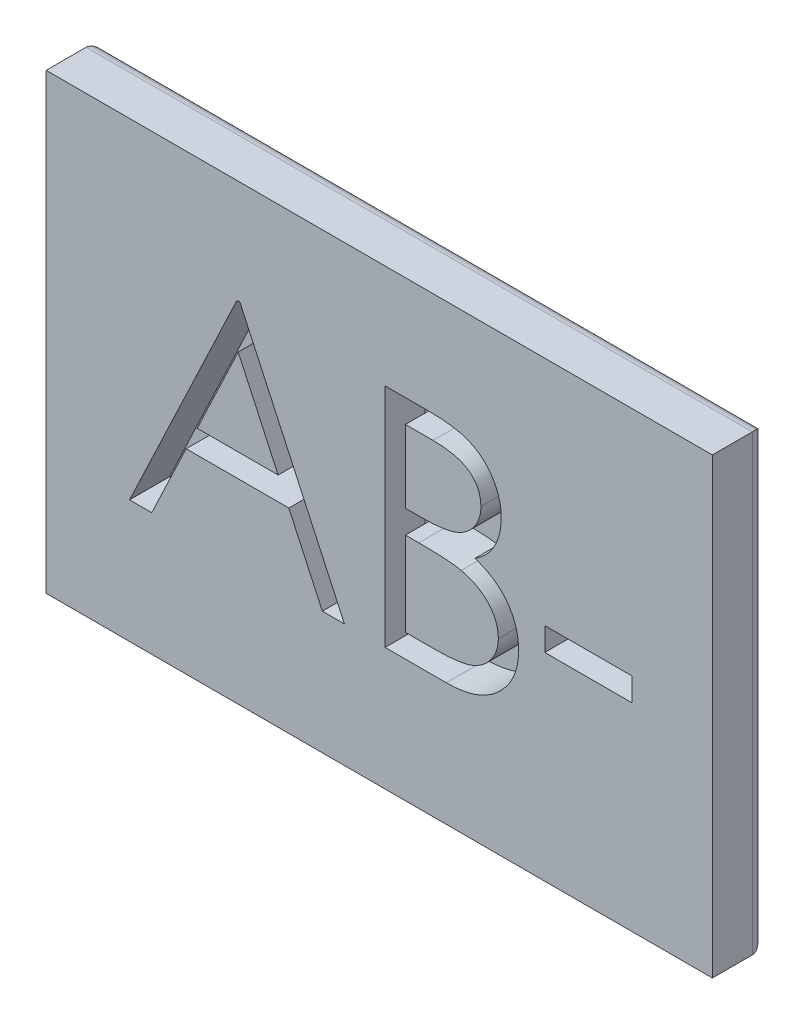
ISO-10303-21;
HEADER;
FILE_DESCRIPTION(('STEP AP214'),'2;1');
FILE_NAME('part.step','',(''),(''),'','','');
FILE_SCHEMA(('AUTOMOTIVE_DESIGN { 1 0 10303 214 1 1 1 1 }'));
ENDSEC;
DATA;
#1=APPLICATION_CONTEXT('core data for automotive mechanical design processes');
#2=APPLICATION_PROTOCOL_DEFINITION('international standard','automotive_design',2000,#1);
#3=PRODUCT_CONTEXT('',#1,'mechanical');
#4=PRODUCT('Part','Part','',(#3));
#5=PRODUCT_RELATED_PRODUCT_CATEGORY('part','',(#4));
#6=PRODUCT_DEFINITION_FORMATION('','',#4);
#7=PRODUCT_DEFINITION_CONTEXT('part definition',#1,'design');
#8=PRODUCT_DEFINITION('design','',#6,#7);
#9=PRODUCT_DEFINITION_SHAPE('','',#8);
#10=(LENGTH_UNIT() NAMED_UNIT(*) SI_UNIT(.MILLI.,.METRE.));
#11=(NAMED_UNIT(*) PLANE_ANGLE_UNIT() SI_UNIT($,.RADIAN.));
#12=(NAMED_UNIT(*) SI_UNIT($,.STERADIAN.) SOLID_ANGLE_UNIT());
#13=UNCERTAINTY_MEASURE_WITH_UNIT(LENGTH_MEASURE(1.E-05),#10,'distance_accuracy_value','');
#14=(GEOMETRIC_REPRESENTATION_CONTEXT(3) GLOBAL_UNCERTAINTY_ASSIGNED_CONTEXT((#13)) GLOBAL_UNIT_ASSIGNED_CONTEXT((#10,
#11,#12)) REPRESENTATION_CONTEXT('',''));
#15=CARTESIAN_POINT('',(0.,0.,0.));
#16=DIRECTION('',(0.,0.,1.));
#17=DIRECTION('',(1.,0.,0.));
#18=AXIS2_PLACEMENT_3D('',#15,#16,#17);
#19=CARTESIAN_POINT('',(0.,0.,2.54));
#20=DIRECTION('',(0.,0.,-1.));
#21=DIRECTION('',(-1.,0.,0.));
#22=AXIS2_PLACEMENT_3D('',#19,#20,#21);
#23=PLANE('',#22);
#24=DIRECTION('',(0.,1.,0.));
#25=VECTOR('',#24,1.);
#26=CARTESIAN_POINT('',(0.276794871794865,-4.94848719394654,2.54));
#27=LINE('',#26,#25);
#28=CARTESIAN_POINT('',(0.276794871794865,-4.94848719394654,2.54));
#29=VERTEX_POINT('',#28);
#30=CARTESIAN_POINT('',(0.276794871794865,5.84651280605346,2.54));
#31=VERTEX_POINT('',#30);
#32=EDGE_CURVE('E64',#29,#31,#27,.T.);
#33=ORIENTED_EDGE('',*,*,#32,.T.);
#34=DIRECTION('',(1.,0.,0.));
#35=VECTOR('',#34,1.);
#36=CARTESIAN_POINT('',(0.276794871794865,5.84651280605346,2.54));
#37=LINE('',#36,#35);
#38=CARTESIAN_POINT('',(2.38303084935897,5.84651280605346,2.54));
#39=VERTEX_POINT('',#38);
#40=EDGE_CURVE('E817',#31,#39,#37,.T.);
#41=ORIENTED_EDGE('',*,*,#40,.T.);
#42=CARTESIAN_POINT('',(2.38303084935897,5.84651280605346,2.54));
#43=CARTESIAN_POINT('',(2.48613382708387,5.84597074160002,2.54));
#44=CARTESIAN_POINT('',(2.68597305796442,5.84492008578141,2.54));
#45=CARTESIAN_POINT('',(2.97657273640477,5.82862539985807,2.54));
#46=CARTESIAN_POINT('',(3.24875728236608,5.80640722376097,2.54));
#47=CARTESIAN_POINT('',(3.50260563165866,5.77115355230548,2.54));
#48=CARTESIAN_POINT('',(3.73800048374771,5.72861577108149,2.54));
#49=CARTESIAN_POINT('',(3.95565123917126,5.67710259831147,2.54));
#50=CARTESIAN_POINT('',(4.15486578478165,5.61533479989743,2.54));
#51=CARTESIAN_POINT('',(4.39270349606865,5.51711176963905,2.54));
#52=CARTESIAN_POINT('',(4.6638759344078,5.3711535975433,2.54));
#53=CARTESIAN_POINT('',(4.95749497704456,5.15547392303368,2.54));
#54=CARTESIAN_POINT('',(5.20856890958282,4.89166736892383,2.54));
#55=CARTESIAN_POINT('',(5.4250435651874,4.59408729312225,2.54));
#56=CARTESIAN_POINT('',(5.59715016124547,4.2667342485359,2.54));
#57=CARTESIAN_POINT('',(5.72166060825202,3.9174105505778,2.54));
#58=CARTESIAN_POINT('',(5.80048839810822,3.55062192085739,2.54));
#59=CARTESIAN_POINT('',(5.80859524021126,3.29881103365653,2.54));
#60=CARTESIAN_POINT('',(5.8126923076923,3.17154986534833,2.54));
#61=B_SPLINE_CURVE_WITH_KNOTS('',3,(#42,#43,#44,#45,#46,#47,#48,#49,#50,#51,#52,#53,#54,#55,#56,
#57,#58,#59,#60),.UNSPECIFIED.,.F.,.F.,(4,1,1,1,1,1,1,1,1,1,1,1,1,1,1,1,4),(0.,
0.0625940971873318,0.121322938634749,0.176680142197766,0.228365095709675,0.276868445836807,
0.321879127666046,0.364098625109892,0.403355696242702,0.477967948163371,0.550535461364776,
0.623584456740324,0.698174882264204,0.773353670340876,0.847281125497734,0.92281833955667,1.),.UNSPECIFIED.);
#62=CARTESIAN_POINT('',(5.8126923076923,3.17154986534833,2.54));
#63=VERTEX_POINT('',#62);
#64=EDGE_CURVE('E808',#39,#63,#61,.T.);
#65=ORIENTED_EDGE('',*,*,#64,.T.);
#66=CARTESIAN_POINT('',(5.8126923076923,3.17154986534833,2.54));
#67=CARTESIAN_POINT('',(5.80932050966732,3.05233434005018,2.54));
#68=CARTESIAN_POINT('',(5.80269460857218,2.81806459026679,2.54));
#69=CARTESIAN_POINT('',(5.73933486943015,2.47541861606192,2.54));
#70=CARTESIAN_POINT('',(5.64014217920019,2.14925164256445,2.54));
#71=CARTESIAN_POINT('',(5.50225841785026,1.84075402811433,2.54));
#72=CARTESIAN_POINT('',(5.323055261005,1.55689606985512,2.54));
#73=CARTESIAN_POINT('',(5.11067653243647,1.29538791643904,2.54));
#74=CARTESIAN_POINT('',(4.85444393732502,1.06730172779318,2.54));
#75=CARTESIAN_POINT('',(4.66246800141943,0.939788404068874,2.54));
#76=CARTESIAN_POINT('',(4.56495292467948,0.875017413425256,2.54));
#77=B_SPLINE_CURVE_WITH_KNOTS('',3,(#66,#67,#68,#69,#70,#71,#72,#73,#74,#75,#76),.UNSPECIFIED.,
.F.,.F.,(4,1,1,1,1,1,1,1,4),(0.,0.13056910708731,0.256580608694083,0.380551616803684,
0.503622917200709,0.625739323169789,0.747548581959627,0.871766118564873,1.),.UNSPECIFIED.);
#78=CARTESIAN_POINT('',(4.56495292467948,0.875017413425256,2.54));
#79=VERTEX_POINT('',#78);
#80=EDGE_CURVE('E799',#63,#79,#77,.T.);
#81=ORIENTED_EDGE('',*,*,#80,.T.);
#82=CARTESIAN_POINT('',(4.56495292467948,0.875017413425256,2.54));
#83=CARTESIAN_POINT('',(4.687585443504,0.827935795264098,2.54));
#84=CARTESIAN_POINT('',(4.92221183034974,0.737856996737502,2.54));
#85=CARTESIAN_POINT('',(5.24509340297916,0.578598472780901,2.54));
#86=CARTESIAN_POINT('',(5.52328007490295,0.405378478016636,2.54));
#87=CARTESIAN_POINT('',(5.75891070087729,0.216213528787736,2.54));
#88=CARTESIAN_POINT('',(5.96043069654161,0.0123150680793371,2.54));
#89=CARTESIAN_POINT('',(6.13639826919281,-0.209306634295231,2.54));
#90=CARTESIAN_POINT('',(6.28654553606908,-0.451542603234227,2.54));
#91=CARTESIAN_POINT('',(6.41520011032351,-0.711867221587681,2.54));
#92=CARTESIAN_POINT('',(6.51558977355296,-0.987622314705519,2.54));
#93=CARTESIAN_POINT('',(6.59077202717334,-1.27622132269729,2.54));
#94=CARTESIAN_POINT('',(6.63385163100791,-1.57662937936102,2.54));
#95=CARTESIAN_POINT('',(6.63998208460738,-1.78107242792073,2.54));
#96=CARTESIAN_POINT('',(6.64307692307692,-1.88428146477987,2.54));
#97=B_SPLINE_CURVE_WITH_KNOTS('',3,(#82,#83,#84,#85,#86,#87,#88,#89,#90,#91,#92,#93,#94,#95,
#96),.UNSPECIFIED.,.F.,.F.,(4,1,1,1,1,1,1,1,1,1,1,1,4),(0.,0.106057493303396,0.20291425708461,
0.290300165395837,0.37022256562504,0.44638372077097,0.521396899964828,0.598291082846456,
0.676142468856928,0.755528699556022,0.834887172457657,0.916646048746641,1.),.UNSPECIFIED.);
#98=CARTESIAN_POINT('',(6.64307692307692,-1.88428146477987,2.54));
#99=VERTEX_POINT('',#98);
#100=EDGE_CURVE('E790',#79,#99,#97,.T.);
#101=ORIENTED_EDGE('',*,*,#100,.T.);
#102=CARTESIAN_POINT('',(6.64307692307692,-1.88428146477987,2.54));
#103=CARTESIAN_POINT('',(6.64006405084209,-1.98966186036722,2.54));
#104=CARTESIAN_POINT('',(6.63413614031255,-2.19700074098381,2.54));
#105=CARTESIAN_POINT('',(6.59040105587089,-2.50158979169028,2.54));
#106=CARTESIAN_POINT('',(6.51635011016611,-2.79266909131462,2.54));
#107=CARTESIAN_POINT('',(6.41434924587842,-3.07212136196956,2.54));
#108=CARTESIAN_POINT('',(6.28122433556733,-3.33940597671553,2.54));
#109=CARTESIAN_POINT('',(6.11921308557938,-3.59482574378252,2.54));
#110=CARTESIAN_POINT('',(5.92603944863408,-3.83581434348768,2.54));
#111=CARTESIAN_POINT('',(5.7099455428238,-4.06504963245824,2.54));
#112=CARTESIAN_POINT('',(5.4654784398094,-4.27116562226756,2.54));
#113=CARTESIAN_POINT('',(5.20172341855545,-4.4547290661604,2.54));
#114=CARTESIAN_POINT('',(4.91535884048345,-4.60569270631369,2.54));
#115=CARTESIAN_POINT('',(4.61108790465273,-4.73250626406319,2.54));
#116=CARTESIAN_POINT('',(4.28549739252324,-4.82937503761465,2.54));
#117=CARTESIAN_POINT('',(3.94004935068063,-4.8971447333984,2.54));
#118=CARTESIAN_POINT('',(3.57504171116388,-4.94280769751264,2.54));
#119=CARTESIAN_POINT('',(3.32456763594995,-4.94656190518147,2.54));
#120=CARTESIAN_POINT('',(3.1961157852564,-4.94848719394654,2.54));
#121=B_SPLINE_CURVE_WITH_KNOTS('',3,(#102,#103,#104,#105,#106,#107,#108,#109,#110,#111,#112,
#113,#114,#115,#116,#117,#118,#119,#120),.UNSPECIFIED.,.F.,.F.,(4,1,1,1,1,1,1,1,1,1,1,1,1,1,1,1,
4),(0.,0.0611602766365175,0.120334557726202,0.178180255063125,0.235235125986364,
0.29268296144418,0.35118624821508,0.410456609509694,0.471719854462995,0.533761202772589,
0.595739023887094,0.657887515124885,0.721295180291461,0.786822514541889,0.854686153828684,
0.925477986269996,1.),.UNSPECIFIED.);
#122=CARTESIAN_POINT('',(3.1961157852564,-4.94848719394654,2.54));
#123=VERTEX_POINT('',#122);
#124=EDGE_CURVE('E784',#99,#123,#121,.T.);
#125=ORIENTED_EDGE('',*,*,#124,.T.);
#126=DIRECTION('',(-1.,0.,0.));
#127=VECTOR('',#126,1.);
#128=CARTESIAN_POINT('',(3.1961157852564,-4.94848719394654,2.54));
#129=LINE('',#128,#127);
#130=EDGE_CURVE('E455',#123,#29,#129,.T.);
#131=ORIENTED_EDGE('',*,*,#130,.T.);
#132=EDGE_LOOP('',(#33,#41,#65,#81,#101,#125,#131));
#133=FACE_BOUND('',#132,.T.);
#134=DIRECTION('',(0.,1.,0.));
#135=VECTOR('',#134,1.);
#136=CARTESIAN_POINT('',(15.875,-10.795,2.54));
#137=LINE('',#136,#135);
#138=CARTESIAN_POINT('',(15.875,-10.795,2.54));
#139=VERTEX_POINT('',#138);
#140=CARTESIAN_POINT('',(15.875,10.795,2.54));
#141=VERTEX_POINT('',#140);
#142=EDGE_CURVE('E583',#139,#141,#137,.T.);
#143=ORIENTED_EDGE('',*,*,#142,.T.);
#144=DIRECTION('',(-1.,0.,0.));
#145=VECTOR('',#144,1.);
#146=CARTESIAN_POINT('',(-15.875,10.795,2.54));
#147=LINE('',#146,#145);
#148=CARTESIAN_POINT('',(-15.875,10.795,2.54));
#149=VERTEX_POINT('',#148);
#150=EDGE_CURVE('E588',#141,#149,#147,.T.);
#151=ORIENTED_EDGE('',*,*,#150,.T.);
#152=DIRECTION('',(0.,-1.,0.));
#153=VECTOR('',#152,1.);
#154=CARTESIAN_POINT('',(-15.875,-10.795,2.54));
#155=LINE('',#154,#153);
#156=CARTESIAN_POINT('',(-15.875,-10.795,2.54));
#157=VERTEX_POINT('',#156);
#158=EDGE_CURVE('E636',#149,#157,#155,.T.);
#159=ORIENTED_EDGE('',*,*,#158,.T.);
#160=DIRECTION('',(1.,0.,0.));
#161=VECTOR('',#160,1.);
#162=CARTESIAN_POINT('',(-15.875,-10.795,2.54));
#163=LINE('',#162,#161);
#164=EDGE_CURVE('E633',#157,#139,#163,.T.);
#165=ORIENTED_EDGE('',*,*,#164,.T.);
#166=EDGE_LOOP('',(#143,#151,#159,#165));
#167=FACE_BOUND('',#166,.T.);
#168=DIRECTION('',(1.,0.,0.));
#169=VECTOR('',#168,1.);
#170=CARTESIAN_POINT('',(-6.78147435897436,5.84651280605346,2.54));
#171=LINE('',#170,#169);
#172=CARTESIAN_POINT('',(-6.78147435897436,5.84651280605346,2.54));
#173=VERTEX_POINT('',#172);
#174=CARTESIAN_POINT('',(-6.64307692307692,5.84651280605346,2.54));
#175=VERTEX_POINT('',#174);
#176=EDGE_CURVE('E698',#173,#175,#171,.T.);
#177=ORIENTED_EDGE('',*,*,#176,.T.);
#178=DIRECTION('',(0.419058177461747,-0.907959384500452,0.));
#179=VECTOR('',#178,1.);
#180=CARTESIAN_POINT('',(-6.64307692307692,5.84651280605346,2.54));
#181=LINE('',#180,#179);
#182=CARTESIAN_POINT('',(-1.66076923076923,-4.94848719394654,2.54));
#183=VERTEX_POINT('',#182);
#184=EDGE_CURVE('E694',#175,#183,#181,.T.);
#185=ORIENTED_EDGE('',*,*,#184,.T.);
#186=DIRECTION('',(-1.,0.,0.));
#187=VECTOR('',#186,1.);
#188=CARTESIAN_POINT('',(-1.66076923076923,-4.94848719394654,2.54));
#189=LINE('',#188,#187);
#190=CARTESIAN_POINT('',(-2.71388721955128,-4.94848719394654,2.54));
#191=VERTEX_POINT('',#190);
#192=EDGE_CURVE('E690',#183,#191,#189,.T.);
#193=ORIENTED_EDGE('',*,*,#192,.T.);
#194=DIRECTION('',(-0.418842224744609,0.908059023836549,0.));
#195=VECTOR('',#194,1.);
#196=CARTESIAN_POINT('',(-2.71388721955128,-4.94848719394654,2.54));
#197=LINE('',#196,#195);
#198=CARTESIAN_POINT('',(-4.30978265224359,-1.48855129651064,2.54));
#199=VERTEX_POINT('',#198);
#200=EDGE_CURVE('E686',#191,#199,#197,.T.);
#201=ORIENTED_EDGE('',*,*,#200,.T.);
#202=DIRECTION('',(-1.,0.,0.));
#203=VECTOR('',#202,1.);
#204=CARTESIAN_POINT('',(-4.30978265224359,-1.48855129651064,2.54));
#205=LINE('',#204,#203);
#206=CARTESIAN_POINT('',(-9.20342948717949,-1.48855129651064,2.54));
#207=VERTEX_POINT('',#206);
#208=EDGE_CURVE('E682',#199,#207,#205,.T.);
#209=ORIENTED_EDGE('',*,*,#208,.T.);
#210=DIRECTION('',(-0.428596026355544,-0.903496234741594,0.));
#211=VECTOR('',#210,1.);
#212=CARTESIAN_POINT('',(-9.20342948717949,-1.48855129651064,2.54));
#213=LINE('',#212,#211);
#214=CARTESIAN_POINT('',(-10.8447365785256,-4.94848719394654,2.54));
#215=VERTEX_POINT('',#214);
#216=EDGE_CURVE('E678',#207,#215,#213,.T.);
#217=ORIENTED_EDGE('',*,*,#216,.T.);
#218=DIRECTION('',(-1.,0.,0.));
#219=VECTOR('',#218,1.);
#220=CARTESIAN_POINT('',(-10.8447365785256,-4.94848719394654,2.54));
#221=LINE('',#220,#219);
#222=CARTESIAN_POINT('',(-11.9021794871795,-4.94848719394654,2.54));
#223=VERTEX_POINT('',#222);
#224=EDGE_CURVE('E674',#215,#223,#221,.T.);
#225=ORIENTED_EDGE('',*,*,#224,.T.);
#226=DIRECTION('',(0.428584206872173,0.903501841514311,0.));
#227=VECTOR('',#226,1.);
#228=CARTESIAN_POINT('',(-11.9021794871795,-4.94848719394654,2.54));
#229=LINE('',#228,#227);
#230=EDGE_CURVE('E669',#223,#173,#229,.T.);
#231=ORIENTED_EDGE('',*,*,#230,.T.);
#232=EDGE_LOOP('',(#177,#185,#193,#201,#209,#217,#225,#231));
#233=FACE_BOUND('',#232,.T.);
#234=DIRECTION('',(0.,1.,0.));
#235=VECTOR('',#234,1.);
#236=CARTESIAN_POINT('',(7.88865384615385,-1.35015386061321,2.54));
#237=LINE('',#236,#235);
#238=CARTESIAN_POINT('',(7.88865384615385,-1.35015386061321,2.54));
#239=VERTEX_POINT('',#238);
#240=CARTESIAN_POINT('',(7.88865384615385,-0.242974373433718,2.54));
#241=VERTEX_POINT('',#240);
#242=EDGE_CURVE('E56',#239,#241,#237,.T.);
#243=ORIENTED_EDGE('',*,*,#242,.T.);
#244=DIRECTION('',(1.,0.,0.));
#245=VECTOR('',#244,1.);
#246=CARTESIAN_POINT('',(7.88865384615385,-0.242974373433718,2.54));
#247=LINE('',#246,#245);
#248=CARTESIAN_POINT('',(12.0405769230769,-0.242974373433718,2.54));
#249=VERTEX_POINT('',#248);
#250=EDGE_CURVE('E314',#241,#249,#247,.T.);
#251=ORIENTED_EDGE('',*,*,#250,.T.);
#252=DIRECTION('',(0.,-1.,0.));
#253=VECTOR('',#252,1.);
#254=CARTESIAN_POINT('',(12.0405769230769,-0.242974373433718,2.54));
#255=LINE('',#254,#253);
#256=CARTESIAN_POINT('',(12.0405769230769,-1.35015386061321,2.54));
#257=VERTEX_POINT('',#256);
#258=EDGE_CURVE('E1043',#249,#257,#255,.T.);
#259=ORIENTED_EDGE('',*,*,#258,.T.);
#260=DIRECTION('',(-1.,0.,0.));
#261=VECTOR('',#260,1.);
#262=CARTESIAN_POINT('',(12.0405769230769,-1.35015386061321,2.54));
#263=LINE('',#262,#261);
#264=EDGE_CURVE('E310',#257,#239,#263,.T.);
#265=ORIENTED_EDGE('',*,*,#264,.T.);
#266=EDGE_LOOP('',(#243,#251,#259,#265));
#267=FACE_BOUND('',#266,.T.);
#268=ADVANCED_FACE('F38',(#133,#167,#233,#267),#23,.F.);
#269=CARTESIAN_POINT('',(15.875,-10.795,2.54));
#270=DIRECTION('',(-1.,0.,0.));
#271=DIRECTION('',(0.,0.,1.));
#272=AXIS2_PLACEMENT_3D('',#269,#270,#271);
#273=PLANE('',#272);
#274=DIRECTION('',(0.,0.,-1.));
#275=VECTOR('',#274,1.);
#276=CARTESIAN_POINT('',(15.875,-10.795,2.54));
#277=LINE('',#276,#275);
#278=CARTESIAN_POINT('',(15.875,-10.795,0.635));
#279=VERTEX_POINT('',#278);
#280=EDGE_CURVE('E629',#139,#279,#277,.T.);
#281=ORIENTED_EDGE('',*,*,#280,.T.);
#282=DIRECTION('',(0.,1.,0.));
#283=VECTOR('',#282,1.);
#284=CARTESIAN_POINT('',(15.875,10.795,0.635));
#285=LINE('',#284,#283);
#286=CARTESIAN_POINT('',(15.875,10.795,0.635));
#287=VERTEX_POINT('',#286);
#288=EDGE_CURVE('E11',#279,#287,#285,.T.);
#289=ORIENTED_EDGE('',*,*,#288,.T.);
#290=DIRECTION('',(0.,0.,-1.));
#291=VECTOR('',#290,1.);
#292=CARTESIAN_POINT('',(15.875,10.795,2.54));
#293=LINE('',#292,#291);
#294=EDGE_CURVE('E617',#141,#287,#293,.T.);
#295=ORIENTED_EDGE('',*,*,#294,.F.);
#296=ORIENTED_EDGE('',*,*,#142,.F.);
#297=EDGE_LOOP('',(#281,#289,#295,#296));
#298=FACE_BOUND('',#297,.T.);
#299=ADVANCED_FACE('F538',(#298),#273,.F.);
#300=CARTESIAN_POINT('',(-15.875,10.795,2.54));
#301=DIRECTION('',(0.,-1.,0.));
#302=DIRECTION('',(0.,0.,-1.));
#303=AXIS2_PLACEMENT_3D('',#300,#301,#302);
#304=PLANE('',#303);
#305=ORIENTED_EDGE('',*,*,#294,.T.);
#306=DIRECTION('',(-1.,0.,0.));
#307=VECTOR('',#306,1.);
#308=CARTESIAN_POINT('',(-15.875,10.795,0.635));
#309=LINE('',#308,#307);
#310=CARTESIAN_POINT('',(-15.875,10.795,0.635));
#311=VERTEX_POINT('',#310);
#312=EDGE_CURVE('E48',#287,#311,#309,.T.);
#313=ORIENTED_EDGE('',*,*,#312,.T.);
#314=DIRECTION('',(0.,0.,-1.));
#315=VECTOR('',#314,1.);
#316=CARTESIAN_POINT('',(-15.875,10.795,2.54));
#317=LINE('',#316,#315);
#318=EDGE_CURVE('E621',#149,#311,#317,.T.);
#319=ORIENTED_EDGE('',*,*,#318,.F.);
#320=ORIENTED_EDGE('',*,*,#150,.F.);
#321=EDGE_LOOP('',(#305,#313,#319,#320));
#322=FACE_BOUND('',#321,.T.);
#323=ADVANCED_FACE('F552',(#322),#304,.F.);
#324=CARTESIAN_POINT('',(-15.875,-10.795,2.54));
#325=DIRECTION('',(1.,0.,0.));
#326=DIRECTION('',(0.,0.,-1.));
#327=AXIS2_PLACEMENT_3D('',#324,#325,#326);
#328=PLANE('',#327);
#329=ORIENTED_EDGE('',*,*,#318,.T.);
#330=DIRECTION('',(0.,-1.,0.));
#331=VECTOR('',#330,1.);
#332=CARTESIAN_POINT('',(-15.875,-10.795,0.635));
#333=LINE('',#332,#331);
#334=CARTESIAN_POINT('',(-15.875,-10.795,0.635));
#335=VERTEX_POINT('',#334);
#336=EDGE_CURVE('E613',#311,#335,#333,.T.);
#337=ORIENTED_EDGE('',*,*,#336,.T.);
#338=DIRECTION('',(0.,0.,-1.));
#339=VECTOR('',#338,1.);
#340=CARTESIAN_POINT('',(-15.875,-10.795,2.54));
#341=LINE('',#340,#339);
#342=EDGE_CURVE('E625',#157,#335,#341,.T.);
#343=ORIENTED_EDGE('',*,*,#342,.F.);
#344=ORIENTED_EDGE('',*,*,#158,.F.);
#345=EDGE_LOOP('',(#329,#337,#343,#344));
#346=FACE_BOUND('',#345,.T.);
#347=ADVANCED_FACE('F548',(#346),#328,.F.);
#348=CARTESIAN_POINT('',(-15.875,-10.795,2.54));
#349=DIRECTION('',(0.,1.,0.));
#350=DIRECTION('',(0.,0.,1.));
#351=AXIS2_PLACEMENT_3D('',#348,#349,#350);
#352=PLANE('',#351);
#353=ORIENTED_EDGE('',*,*,#342,.T.);
#354=DIRECTION('',(1.,0.,0.));
#355=VECTOR('',#354,1.);
#356=CARTESIAN_POINT('',(15.875,-10.795,0.635));
#357=LINE('',#356,#355);
#358=EDGE_CURVE('E599',#335,#279,#357,.T.);
#359=ORIENTED_EDGE('',*,*,#358,.T.);
#360=ORIENTED_EDGE('',*,*,#280,.F.);
#361=ORIENTED_EDGE('',*,*,#164,.F.);
#362=EDGE_LOOP('',(#353,#359,#360,#361));
#363=FACE_BOUND('',#362,.T.);
#364=ADVANCED_FACE('F544',(#363),#352,.F.);
#365=CARTESIAN_POINT('',(0.,0.,0.));
#366=DIRECTION('',(0.,0.,-1.));
#367=DIRECTION('',(-1.,0.,0.));
#368=AXIS2_PLACEMENT_3D('',#365,#366,#367);
#369=PLANE('',#368);
#370=DIRECTION('',(1.,0.,0.));
#371=VECTOR('',#370,1.);
#372=CARTESIAN_POINT('',(-15.875,-10.16,0.));
#373=LINE('',#372,#371);
#374=CARTESIAN_POINT('',(15.24,-10.16,0.));
#375=VERTEX_POINT('',#374);
#376=CARTESIAN_POINT('',(-15.24,-10.16,0.));
#377=VERTEX_POINT('',#376);
#378=EDGE_CURVE('E605',#375,#377,#373,.F.);
#379=ORIENTED_EDGE('',*,*,#378,.T.);
#380=DIRECTION('',(0.,-1.,0.));
#381=VECTOR('',#380,1.);
#382=CARTESIAN_POINT('',(-15.24,10.795,0.));
#383=LINE('',#382,#381);
#384=CARTESIAN_POINT('',(-15.24,10.16,0.));
#385=VERTEX_POINT('',#384);
#386=EDGE_CURVE('E602',#377,#385,#383,.F.);
#387=ORIENTED_EDGE('',*,*,#386,.T.);
#388=DIRECTION('',(-1.,0.,0.));
#389=VECTOR('',#388,1.);
#390=CARTESIAN_POINT('',(15.875,10.16,0.));
#391=LINE('',#390,#389);
#392=CARTESIAN_POINT('',(15.24,10.16,0.));
#393=VERTEX_POINT('',#392);
#394=EDGE_CURVE('E578',#385,#393,#391,.F.);
#395=ORIENTED_EDGE('',*,*,#394,.T.);
#396=DIRECTION('',(0.,1.,0.));
#397=VECTOR('',#396,1.);
#398=CARTESIAN_POINT('',(15.24,-10.795,0.));
#399=LINE('',#398,#397);
#400=EDGE_CURVE('E610',#393,#375,#399,.F.);
#401=ORIENTED_EDGE('',*,*,#400,.T.);
#402=EDGE_LOOP('',(#379,#387,#395,#401));
#403=FACE_BOUND('',#402,.T.);
#404=ADVANCED_FACE('F541',(#403),#369,.T.);
#405=CARTESIAN_POINT('',(15.24,-10.795,0.635));
#406=DIRECTION('',(0.,-1.,0.));
#407=DIRECTION('',(0.,0.,-1.));
#408=AXIS2_PLACEMENT_3D('',#405,#406,#407);
#409=CYLINDRICAL_SURFACE('',#408,0.635);
#410=CARTESIAN_POINT('',(15.24,-10.16,0.635));
#411=DIRECTION('',(-0.707106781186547,-0.707106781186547,0.));
#412=DIRECTION('',(0.707106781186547,-0.707106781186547,0.));
#413=AXIS2_PLACEMENT_3D('',#410,#411,#412);
#414=ELLIPSE('',#413,0.898025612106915,0.635);
#415=EDGE_CURVE('E584',#375,#279,#414,.T.);
#416=ORIENTED_EDGE('',*,*,#415,.F.);
#417=ORIENTED_EDGE('',*,*,#400,.F.);
#418=CARTESIAN_POINT('',(15.24,10.16,0.635));
#419=DIRECTION('',(0.707106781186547,-0.707106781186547,0.));
#420=DIRECTION('',(-0.707106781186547,-0.707106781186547,0.));
#421=AXIS2_PLACEMENT_3D('',#418,#419,#420);
#422=ELLIPSE('',#421,0.898025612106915,0.635);
#423=EDGE_CURVE('E42',#287,#393,#422,.F.);
#424=ORIENTED_EDGE('',*,*,#423,.F.);
#425=ORIENTED_EDGE('',*,*,#288,.F.);
#426=EDGE_LOOP('',(#416,#417,#424,#425));
#427=FACE_BOUND('',#426,.T.);
#428=ADVANCED_FACE('F40',(#427),#409,.T.);
#429=CARTESIAN_POINT('',(-15.875,10.16,0.635));
#430=DIRECTION('',(1.,0.,0.));
#431=DIRECTION('',(0.,0.,-1.));
#432=AXIS2_PLACEMENT_3D('',#429,#430,#431);
#433=CYLINDRICAL_SURFACE('',#432,0.635);
#434=ORIENTED_EDGE('',*,*,#423,.T.);
#435=ORIENTED_EDGE('',*,*,#394,.F.);
#436=CARTESIAN_POINT('',(-15.24,10.16,0.635));
#437=DIRECTION('',(0.707106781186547,0.707106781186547,0.));
#438=DIRECTION('',(0.707106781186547,-0.707106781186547,0.));
#439=AXIS2_PLACEMENT_3D('',#436,#437,#438);
#440=ELLIPSE('',#439,0.898025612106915,0.635);
#441=EDGE_CURVE('E321',#311,#385,#440,.F.);
#442=ORIENTED_EDGE('',*,*,#441,.F.);
#443=ORIENTED_EDGE('',*,*,#312,.F.);
#444=EDGE_LOOP('',(#434,#435,#442,#443));
#445=FACE_BOUND('',#444,.T.);
#446=ADVANCED_FACE('F565',(#445),#433,.T.);
#447=CARTESIAN_POINT('',(-15.875,-10.16,0.635));
#448=DIRECTION('',(-1.,0.,0.));
#449=DIRECTION('',(0.,0.,1.));
#450=AXIS2_PLACEMENT_3D('',#447,#448,#449);
#451=CYLINDRICAL_SURFACE('',#450,0.635);
#452=ORIENTED_EDGE('',*,*,#415,.T.);
#453=ORIENTED_EDGE('',*,*,#358,.F.);
#454=CARTESIAN_POINT('',(-15.24,-10.16,0.635));
#455=DIRECTION('',(-0.707106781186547,0.707106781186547,0.));
#456=DIRECTION('',(-0.707106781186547,-0.707106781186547,0.));
#457=AXIS2_PLACEMENT_3D('',#454,#455,#456);
#458=ELLIPSE('',#457,0.898025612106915,0.635);
#459=EDGE_CURVE('E316',#377,#335,#458,.T.);
#460=ORIENTED_EDGE('',*,*,#459,.F.);
#461=ORIENTED_EDGE('',*,*,#378,.F.);
#462=EDGE_LOOP('',(#452,#453,#460,#461));
#463=FACE_BOUND('',#462,.T.);
#464=ADVANCED_FACE('F562',(#463),#451,.T.);
#465=CARTESIAN_POINT('',(-15.24,-10.795,0.635));
#466=DIRECTION('',(0.,1.,0.));
#467=DIRECTION('',(0.,0.,1.));
#468=AXIS2_PLACEMENT_3D('',#465,#466,#467);
#469=CYLINDRICAL_SURFACE('',#468,0.635);
#470=ORIENTED_EDGE('',*,*,#441,.T.);
#471=ORIENTED_EDGE('',*,*,#386,.F.);
#472=ORIENTED_EDGE('',*,*,#459,.T.);
#473=ORIENTED_EDGE('',*,*,#336,.F.);
#474=EDGE_LOOP('',(#470,#471,#472,#473));
#475=FACE_BOUND('',#474,.T.);
#476=ADVANCED_FACE('F534',(#475),#469,.T.);
#477=CARTESIAN_POINT('',(-6.78147435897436,5.84651280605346,0.635));
#478=DIRECTION('',(0.,-1.,0.));
#479=DIRECTION('',(0.,0.,-1.));
#480=AXIS2_PLACEMENT_3D('',#477,#478,#479);
#481=PLANE('',#480);
#482=ORIENTED_EDGE('',*,*,#176,.F.);
#483=DIRECTION('',(0.,0.,1.));
#484=VECTOR('',#483,1.);
#485=CARTESIAN_POINT('',(-6.78147435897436,5.84651280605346,0.635));
#486=LINE('',#485,#484);
#487=CARTESIAN_POINT('',(-6.78147435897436,5.84651280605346,0.635));
#488=VERTEX_POINT('',#487);
#489=EDGE_CURVE('E664',#488,#173,#486,.T.);
#490=ORIENTED_EDGE('',*,*,#489,.F.);
#491=DIRECTION('',(1.,0.,0.));
#492=VECTOR('',#491,1.);
#493=CARTESIAN_POINT('',(-6.78147435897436,5.84651280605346,0.635));
#494=LINE('',#493,#492);
#495=CARTESIAN_POINT('',(-6.64307692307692,5.84651280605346,0.635));
#496=VERTEX_POINT('',#495);
#497=EDGE_CURVE('E673',#488,#496,#494,.T.);
#498=ORIENTED_EDGE('',*,*,#497,.T.);
#499=DIRECTION('',(0.,0.,1.));
#500=VECTOR('',#499,1.);
#501=CARTESIAN_POINT('',(-6.64307692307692,5.84651280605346,0.635));
#502=LINE('',#501,#500);
#503=EDGE_CURVE('E641',#496,#175,#502,.T.);
#504=ORIENTED_EDGE('',*,*,#503,.T.);
#505=EDGE_LOOP('',(#482,#490,#498,#504));
#506=FACE_BOUND('',#505,.T.);
#507=ADVANCED_FACE('F530',(#506),#481,.T.);
#508=CARTESIAN_POINT('',(-6.64307692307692,5.84651280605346,0.635));
#509=DIRECTION('',(-0.907959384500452,-0.419058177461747,0.));
#510=DIRECTION('',(0.419058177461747,-0.907959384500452,0.));
#511=AXIS2_PLACEMENT_3D('',#508,#509,#510);
#512=PLANE('',#511);
#513=ORIENTED_EDGE('',*,*,#184,.F.);
#514=ORIENTED_EDGE('',*,*,#503,.F.);
#515=DIRECTION('',(0.419058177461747,-0.907959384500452,0.));
#516=VECTOR('',#515,1.);
#517=CARTESIAN_POINT('',(-6.64307692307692,5.84651280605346,0.635));
#518=LINE('',#517,#516);
#519=CARTESIAN_POINT('',(-1.66076923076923,-4.94848719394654,0.635));
#520=VERTEX_POINT('',#519);
#521=EDGE_CURVE('E720',#496,#520,#518,.T.);
#522=ORIENTED_EDGE('',*,*,#521,.T.);
#523=DIRECTION('',(0.,0.,1.));
#524=VECTOR('',#523,1.);
#525=CARTESIAN_POINT('',(-1.66076923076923,-4.94848719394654,0.635));
#526=LINE('',#525,#524);
#527=EDGE_CURVE('E646',#520,#183,#526,.T.);
#528=ORIENTED_EDGE('',*,*,#527,.T.);
#529=EDGE_LOOP('',(#513,#514,#522,#528));
#530=FACE_BOUND('',#529,.T.);
#531=ADVANCED_FACE('F526',(#530),#512,.T.);
#532=CARTESIAN_POINT('',(-1.66076923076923,-4.94848719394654,0.635));
#533=DIRECTION('',(0.,1.,0.));
#534=DIRECTION('',(0.,0.,1.));
#535=AXIS2_PLACEMENT_3D('',#532,#533,#534);
#536=PLANE('',#535);
#537=ORIENTED_EDGE('',*,*,#192,.F.);
#538=ORIENTED_EDGE('',*,*,#527,.F.);
#539=DIRECTION('',(-1.,0.,0.));
#540=VECTOR('',#539,1.);
#541=CARTESIAN_POINT('',(-1.66076923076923,-4.94848719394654,0.635));
#542=LINE('',#541,#540);
#543=CARTESIAN_POINT('',(-2.71388721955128,-4.94848719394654,0.635));
#544=VERTEX_POINT('',#543);
#545=EDGE_CURVE('E717',#520,#544,#542,.T.);
#546=ORIENTED_EDGE('',*,*,#545,.T.);
#547=DIRECTION('',(0.,0.,1.));
#548=VECTOR('',#547,1.);
#549=CARTESIAN_POINT('',(-2.71388721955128,-4.94848719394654,0.635));
#550=LINE('',#549,#548);
#551=EDGE_CURVE('E649',#544,#191,#550,.T.);
#552=ORIENTED_EDGE('',*,*,#551,.T.);
#553=EDGE_LOOP('',(#537,#538,#546,#552));
#554=FACE_BOUND('',#553,.T.);
#555=ADVANCED_FACE('F522',(#554),#536,.T.);
#556=CARTESIAN_POINT('',(-2.71388721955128,-4.94848719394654,0.635));
#557=DIRECTION('',(0.908059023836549,0.418842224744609,0.));
#558=DIRECTION('',(-0.418842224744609,0.908059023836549,0.));
#559=AXIS2_PLACEMENT_3D('',#556,#557,#558);
#560=PLANE('',#559);
#561=ORIENTED_EDGE('',*,*,#200,.F.);
#562=ORIENTED_EDGE('',*,*,#551,.F.);
#563=DIRECTION('',(-0.418842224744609,0.908059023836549,0.));
#564=VECTOR('',#563,1.);
#565=CARTESIAN_POINT('',(-2.71388721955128,-4.94848719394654,0.635));
#566=LINE('',#565,#564);
#567=CARTESIAN_POINT('',(-4.30978265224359,-1.48855129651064,0.635));
#568=VERTEX_POINT('',#567);
#569=EDGE_CURVE('E714',#544,#568,#566,.T.);
#570=ORIENTED_EDGE('',*,*,#569,.T.);
#571=DIRECTION('',(0.,0.,1.));
#572=VECTOR('',#571,1.);
#573=CARTESIAN_POINT('',(-4.30978265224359,-1.48855129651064,0.635));
#574=LINE('',#573,#572);
#575=EDGE_CURVE('E652',#568,#199,#574,.T.);
#576=ORIENTED_EDGE('',*,*,#575,.T.);
#577=EDGE_LOOP('',(#561,#562,#570,#576));
#578=FACE_BOUND('',#577,.T.);
#579=ADVANCED_FACE('F518',(#578),#560,.T.);
#580=CARTESIAN_POINT('',(-4.30978265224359,-1.48855129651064,0.635));
#581=DIRECTION('',(0.,1.,0.));
#582=DIRECTION('',(0.,0.,1.));
#583=AXIS2_PLACEMENT_3D('',#580,#581,#582);
#584=PLANE('',#583);
#585=ORIENTED_EDGE('',*,*,#208,.F.);
#586=ORIENTED_EDGE('',*,*,#575,.F.);
#587=DIRECTION('',(-1.,0.,0.));
#588=VECTOR('',#587,1.);
#589=CARTESIAN_POINT('',(-4.30978265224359,-1.48855129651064,0.635));
#590=LINE('',#589,#588);
#591=CARTESIAN_POINT('',(-9.20342948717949,-1.48855129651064,0.635));
#592=VERTEX_POINT('',#591);
#593=EDGE_CURVE('E711',#568,#592,#590,.T.);
#594=ORIENTED_EDGE('',*,*,#593,.T.);
#595=DIRECTION('',(0.,0.,1.));
#596=VECTOR('',#595,1.);
#597=CARTESIAN_POINT('',(-9.20342948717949,-1.48855129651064,0.635));
#598=LINE('',#597,#596);
#599=EDGE_CURVE('E655',#592,#207,#598,.T.);
#600=ORIENTED_EDGE('',*,*,#599,.T.);
#601=EDGE_LOOP('',(#585,#586,#594,#600));
#602=FACE_BOUND('',#601,.T.);
#603=ADVANCED_FACE('F514',(#602),#584,.T.);
#604=CARTESIAN_POINT('',(-9.20342948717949,-1.48855129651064,0.635));
#605=DIRECTION('',(-0.903496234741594,0.428596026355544,0.));
#606=DIRECTION('',(-0.428596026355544,-0.903496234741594,0.));
#607=AXIS2_PLACEMENT_3D('',#604,#605,#606);
#608=PLANE('',#607);
#609=ORIENTED_EDGE('',*,*,#216,.F.);
#610=ORIENTED_EDGE('',*,*,#599,.F.);
#611=DIRECTION('',(-0.428596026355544,-0.903496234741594,0.));
#612=VECTOR('',#611,1.);
#613=CARTESIAN_POINT('',(-9.20342948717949,-1.48855129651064,0.635));
#614=LINE('',#613,#612);
#615=CARTESIAN_POINT('',(-10.8447365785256,-4.94848719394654,0.635));
#616=VERTEX_POINT('',#615);
#617=EDGE_CURVE('E708',#592,#616,#614,.T.);
#618=ORIENTED_EDGE('',*,*,#617,.T.);
#619=DIRECTION('',(0.,0.,1.));
#620=VECTOR('',#619,1.);
#621=CARTESIAN_POINT('',(-10.8447365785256,-4.94848719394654,0.635));
#622=LINE('',#621,#620);
#623=EDGE_CURVE('E658',#616,#215,#622,.T.);
#624=ORIENTED_EDGE('',*,*,#623,.T.);
#625=EDGE_LOOP('',(#609,#610,#618,#624));
#626=FACE_BOUND('',#625,.T.);
#627=ADVANCED_FACE('F510',(#626),#608,.T.);
#628=CARTESIAN_POINT('',(-10.8447365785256,-4.94848719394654,0.635));
#629=DIRECTION('',(0.,1.,0.));
#630=DIRECTION('',(0.,0.,1.));
#631=AXIS2_PLACEMENT_3D('',#628,#629,#630);
#632=PLANE('',#631);
#633=ORIENTED_EDGE('',*,*,#224,.F.);
#634=ORIENTED_EDGE('',*,*,#623,.F.);
#635=DIRECTION('',(-1.,0.,0.));
#636=VECTOR('',#635,1.);
#637=CARTESIAN_POINT('',(-10.8447365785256,-4.94848719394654,0.635));
#638=LINE('',#637,#636);
#639=CARTESIAN_POINT('',(-11.9021794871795,-4.94848719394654,0.635));
#640=VERTEX_POINT('',#639);
#641=EDGE_CURVE('E705',#616,#640,#638,.T.);
#642=ORIENTED_EDGE('',*,*,#641,.T.);
#643=DIRECTION('',(0.,0.,1.));
#644=VECTOR('',#643,1.);
#645=CARTESIAN_POINT('',(-11.9021794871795,-4.94848719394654,0.635));
#646=LINE('',#645,#644);
#647=EDGE_CURVE('E661',#640,#223,#646,.T.);
#648=ORIENTED_EDGE('',*,*,#647,.T.);
#649=EDGE_LOOP('',(#633,#634,#642,#648));
#650=FACE_BOUND('',#649,.T.);
#651=ADVANCED_FACE('F506',(#650),#632,.T.);
#652=CARTESIAN_POINT('',(-11.9021794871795,-4.94848719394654,0.635));
#653=DIRECTION('',(0.90350184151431,-0.428584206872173,0.));
#654=DIRECTION('',(0.428584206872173,0.903501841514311,0.));
#655=AXIS2_PLACEMENT_3D('',#652,#653,#654);
#656=PLANE('',#655);
#657=ORIENTED_EDGE('',*,*,#230,.F.);
#658=ORIENTED_EDGE('',*,*,#647,.F.);
#659=DIRECTION('',(0.428584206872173,0.903501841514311,0.));
#660=VECTOR('',#659,1.);
#661=CARTESIAN_POINT('',(-11.9021794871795,-4.94848719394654,0.635));
#662=LINE('',#661,#660);
#663=EDGE_CURVE('E668',#640,#488,#662,.T.);
#664=ORIENTED_EDGE('',*,*,#663,.T.);
#665=ORIENTED_EDGE('',*,*,#489,.T.);
#666=EDGE_LOOP('',(#657,#658,#664,#665));
#667=FACE_BOUND('',#666,.T.);
#668=ADVANCED_FACE('F502',(#667),#656,.T.);
#669=CARTESIAN_POINT('',(0.,0.,0.634999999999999));
#670=DIRECTION('',(0.,0.,1.));
#671=DIRECTION('',(1.,0.,0.));
#672=AXIS2_PLACEMENT_3D('',#669,#670,#671);
#673=PLANE('',#672);
#674=DIRECTION('',(1.,0.,0.));
#675=VECTOR('',#674,1.);
#676=CARTESIAN_POINT('',(-8.67795172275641,-0.381371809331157,0.635));
#677=LINE('',#676,#675);
#678=CARTESIAN_POINT('',(-8.67795172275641,-0.381371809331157,0.634999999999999));
#679=VERTEX_POINT('',#678);
#680=CARTESIAN_POINT('',(-4.82012319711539,-0.381371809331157,0.635));
#681=VERTEX_POINT('',#680);
#682=EDGE_CURVE('E730',#679,#681,#677,.T.);
#683=ORIENTED_EDGE('',*,*,#682,.F.);
#684=DIRECTION('',(-0.428351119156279,-0.903612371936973,0.));
#685=VECTOR('',#684,1.);
#686=CARTESIAN_POINT('',(-6.72308794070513,3.74243928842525,0.635));
#687=LINE('',#686,#685);
#688=CARTESIAN_POINT('',(-6.72308794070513,3.74243928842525,0.635));
#689=VERTEX_POINT('',#688);
#690=EDGE_CURVE('E752',#689,#679,#687,.T.);
#691=ORIENTED_EDGE('',*,*,#690,.F.);
#692=DIRECTION('',(-0.418997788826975,0.907987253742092,0.));
#693=VECTOR('',#692,1.);
#694=CARTESIAN_POINT('',(-4.82012319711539,-0.381371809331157,0.635));
#695=LINE('',#694,#693);
#696=EDGE_CURVE('E740',#681,#689,#695,.T.);
#697=ORIENTED_EDGE('',*,*,#696,.F.);
#698=EDGE_LOOP('',(#683,#691,#697));
#699=FACE_BOUND('',#698,.T.);
#700=ORIENTED_EDGE('',*,*,#497,.F.);
#701=ORIENTED_EDGE('',*,*,#663,.F.);
#702=ORIENTED_EDGE('',*,*,#641,.F.);
#703=ORIENTED_EDGE('',*,*,#617,.F.);
#704=ORIENTED_EDGE('',*,*,#593,.F.);
#705=ORIENTED_EDGE('',*,*,#569,.F.);
#706=ORIENTED_EDGE('',*,*,#545,.F.);
#707=ORIENTED_EDGE('',*,*,#521,.F.);
#708=EDGE_LOOP('',(#700,#701,#702,#703,#704,#705,#706,#707));
#709=FACE_BOUND('',#708,.T.);
#710=ADVANCED_FACE('F498',(#699,#709),#673,.T.);
#711=CARTESIAN_POINT('',(-4.82012319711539,-0.381371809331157,0.635));
#712=DIRECTION('',(0.907987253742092,0.418997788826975,0.));
#713=DIRECTION('',(-0.418997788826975,0.907987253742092,0.));
#714=AXIS2_PLACEMENT_3D('',#711,#712,#713);
#715=PLANE('',#714);
#716=DIRECTION('',(-0.418997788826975,0.907987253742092,0.));
#717=VECTOR('',#716,1.);
#718=CARTESIAN_POINT('',(-4.82012319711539,-0.381371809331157,2.54));
#719=LINE('',#718,#717);
#720=CARTESIAN_POINT('',(-4.82012319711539,-0.381371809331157,2.54));
#721=VERTEX_POINT('',#720);
#722=CARTESIAN_POINT('',(-6.72308794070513,3.74243928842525,2.54));
#723=VERTEX_POINT('',#722);
#724=EDGE_CURVE('E745',#721,#723,#719,.T.);
#725=ORIENTED_EDGE('',*,*,#724,.F.);
#726=DIRECTION('',(0.,0.,1.));
#727=VECTOR('',#726,1.);
#728=CARTESIAN_POINT('',(-4.82012319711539,-0.381371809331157,0.635));
#729=LINE('',#728,#727);
#730=EDGE_CURVE('E702',#681,#721,#729,.T.);
#731=ORIENTED_EDGE('',*,*,#730,.F.);
#732=ORIENTED_EDGE('',*,*,#696,.T.);
#733=DIRECTION('',(0.,0.,1.));
#734=VECTOR('',#733,1.);
#735=CARTESIAN_POINT('',(-6.72308794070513,3.74243928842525,0.635));
#736=LINE('',#735,#734);
#737=EDGE_CURVE('E726',#689,#723,#736,.T.);
#738=ORIENTED_EDGE('',*,*,#737,.T.);
#739=EDGE_LOOP('',(#725,#731,#732,#738));
#740=FACE_BOUND('',#739,.T.);
#741=ADVANCED_FACE('F491',(#740),#715,.T.);
#742=CARTESIAN_POINT('',(-8.67795172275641,-0.381371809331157,0.635));
#743=DIRECTION('',(0.,-1.,0.));
#744=DIRECTION('',(0.,0.,-1.));
#745=AXIS2_PLACEMENT_3D('',#742,#743,#744);
#746=PLANE('',#745);
#747=DIRECTION('',(1.,0.,0.));
#748=VECTOR('',#747,1.);
#749=CARTESIAN_POINT('',(-8.67795172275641,-0.381371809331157,2.54));
#750=LINE('',#749,#748);
#751=CARTESIAN_POINT('',(-8.67795172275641,-0.381371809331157,2.54));
#752=VERTEX_POINT('',#751);
#753=EDGE_CURVE('E736',#752,#721,#750,.T.);
#754=ORIENTED_EDGE('',*,*,#753,.F.);
#755=DIRECTION('',(0.,0.,1.));
#756=VECTOR('',#755,1.);
#757=CARTESIAN_POINT('',(-8.67795172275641,-0.381371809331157,0.635));
#758=LINE('',#757,#756);
#759=EDGE_CURVE('E729',#679,#752,#758,.T.);
#760=ORIENTED_EDGE('',*,*,#759,.F.);
#761=ORIENTED_EDGE('',*,*,#682,.T.);
#762=ORIENTED_EDGE('',*,*,#730,.T.);
#763=EDGE_LOOP('',(#754,#760,#761,#762));
#764=FACE_BOUND('',#763,.T.);
#765=ADVANCED_FACE('F488',(#764),#746,.T.);
#766=CARTESIAN_POINT('',(-6.72308794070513,3.74243928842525,0.635));
#767=DIRECTION('',(-0.903612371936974,0.428351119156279,0.));
#768=DIRECTION('',(-0.428351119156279,-0.903612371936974,0.));
#769=AXIS2_PLACEMENT_3D('',#766,#767,#768);
#770=PLANE('',#769);
#771=DIRECTION('',(-0.428351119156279,-0.903612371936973,0.));
#772=VECTOR('',#771,1.);
#773=CARTESIAN_POINT('',(-6.72308794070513,3.74243928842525,2.54));
#774=LINE('',#773,#772);
#775=EDGE_CURVE('E741',#723,#752,#774,.T.);
#776=ORIENTED_EDGE('',*,*,#775,.F.);
#777=ORIENTED_EDGE('',*,*,#737,.F.);
#778=ORIENTED_EDGE('',*,*,#690,.T.);
#779=ORIENTED_EDGE('',*,*,#759,.T.);
#780=EDGE_LOOP('',(#776,#777,#778,#779));
#781=FACE_BOUND('',#780,.T.);
#782=ADVANCED_FACE('F487',(#781),#770,.T.);
#783=CARTESIAN_POINT('',(0.276794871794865,-4.94848719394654,0.635));
#784=DIRECTION('',(1.,0.,0.));
#785=DIRECTION('',(0.,0.,-1.));
#786=AXIS2_PLACEMENT_3D('',#783,#784,#785);
#787=PLANE('',#786);
#788=ORIENTED_EDGE('',*,*,#32,.F.);
#789=DIRECTION('',(0.,0.,1.));
#790=VECTOR('',#789,1.);
#791=CARTESIAN_POINT('',(0.276794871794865,-4.94848719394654,0.635));
#792=LINE('',#791,#790);
#793=CARTESIAN_POINT('',(0.276794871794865,-4.94848719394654,0.635));
#794=VERTEX_POINT('',#793);
#795=EDGE_CURVE('E777',#794,#29,#792,.T.);
#796=ORIENTED_EDGE('',*,*,#795,.F.);
#797=DIRECTION('',(0.,1.,0.));
#798=VECTOR('',#797,1.);
#799=CARTESIAN_POINT('',(0.276794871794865,-4.94848719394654,0.635));
#800=LINE('',#799,#798);
#801=CARTESIAN_POINT('',(0.276794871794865,5.84651280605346,0.635));
#802=VERTEX_POINT('',#801);
#803=EDGE_CURVE('E450',#794,#802,#800,.T.);
#804=ORIENTED_EDGE('',*,*,#803,.T.);
#805=DIRECTION('',(0.,0.,1.));
#806=VECTOR('',#805,1.);
#807=CARTESIAN_POINT('',(0.276794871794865,5.84651280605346,0.635));
#808=LINE('',#807,#806);
#809=EDGE_CURVE('E759',#802,#31,#808,.T.);
#810=ORIENTED_EDGE('',*,*,#809,.T.);
#811=EDGE_LOOP('',(#788,#796,#804,#810));
#812=FACE_BOUND('',#811,.T.);
#813=ADVANCED_FACE('F483',(#812),#787,.T.);
#814=CARTESIAN_POINT('',(0.276794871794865,5.84651280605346,0.635));
#815=DIRECTION('',(0.,-1.,0.));
#816=DIRECTION('',(0.,0.,-1.));
#817=AXIS2_PLACEMENT_3D('',#814,#815,#816);
#818=PLANE('',#817);
#819=ORIENTED_EDGE('',*,*,#40,.F.);
#820=ORIENTED_EDGE('',*,*,#809,.F.);
#821=DIRECTION('',(1.,0.,0.));
#822=VECTOR('',#821,1.);
#823=CARTESIAN_POINT('',(0.276794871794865,5.84651280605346,0.635));
#824=LINE('',#823,#822);
#825=CARTESIAN_POINT('',(2.38303084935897,5.84651280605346,0.635));
#826=VERTEX_POINT('',#825);
#827=EDGE_CURVE('E454',#802,#826,#824,.T.);
#828=ORIENTED_EDGE('',*,*,#827,.T.);
#829=DIRECTION('',(0.,0.,1.));
#830=VECTOR('',#829,1.);
#831=CARTESIAN_POINT('',(2.38303084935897,5.84651280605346,0.635));
#832=LINE('',#831,#830);
#833=EDGE_CURVE('E762',#826,#39,#832,.T.);
#834=ORIENTED_EDGE('',*,*,#833,.T.);
#835=EDGE_LOOP('',(#819,#820,#828,#834));
#836=FACE_BOUND('',#835,.T.);
#837=ADVANCED_FACE('F478',(#836),#818,.T.);
#838=CARTESIAN_POINT('',(2.38303084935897,5.84651280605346,0.635));
#839=CARTESIAN_POINT('',(2.48613382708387,5.84597074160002,0.635));
#840=CARTESIAN_POINT('',(2.68597305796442,5.84492008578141,0.635000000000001));
#841=CARTESIAN_POINT('',(2.97657273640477,5.82862539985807,0.634999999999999));
#842=CARTESIAN_POINT('',(3.24875728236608,5.80640722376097,0.635));
#843=CARTESIAN_POINT('',(3.50260563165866,5.77115355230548,0.635000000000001));
#844=CARTESIAN_POINT('',(3.73800048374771,5.72861577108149,0.635));
#845=CARTESIAN_POINT('',(3.95565123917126,5.67710259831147,0.635));
#846=CARTESIAN_POINT('',(4.15486578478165,5.61533479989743,0.635));
#847=CARTESIAN_POINT('',(4.39270349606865,5.51711176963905,0.635000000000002));
#848=CARTESIAN_POINT('',(4.6638759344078,5.3711535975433,0.635));
#849=CARTESIAN_POINT('',(4.95749497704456,5.15547392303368,0.635000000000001));
#850=CARTESIAN_POINT('',(5.20856890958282,4.89166736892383,0.635));
#851=CARTESIAN_POINT('',(5.4250435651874,4.59408729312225,0.635));
#852=CARTESIAN_POINT('',(5.59715016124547,4.2667342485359,0.635));
#853=CARTESIAN_POINT('',(5.72166060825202,3.9174105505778,0.635));
#854=CARTESIAN_POINT('',(5.80048839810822,3.55062192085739,0.635));
#855=CARTESIAN_POINT('',(5.80859524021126,3.29881103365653,0.635));
#856=CARTESIAN_POINT('',(5.8126923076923,3.17154986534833,0.635));
#857=B_SPLINE_CURVE_WITH_KNOTS('',3,(#838,#839,#840,#841,#842,#843,#844,#845,#846,#847,#848,
#849,#850,#851,#852,#853,#854,#855,#856),.UNSPECIFIED.,.F.,.F.,(4,1,1,1,1,1,1,1,1,1,1,1,1,1,1,1,
4),(0.,0.0625940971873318,0.121322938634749,0.176680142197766,0.228365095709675,
0.276868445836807,0.321879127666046,0.364098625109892,0.403355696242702,0.477967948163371,
0.550535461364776,0.623584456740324,0.698174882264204,0.773353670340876,0.847281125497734,
0.92281833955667,1.),.UNSPECIFIED.);
#858=DIRECTION('',(0.,0.,1.));
#859=VECTOR('',#858,1.);
#860=SURFACE_OF_LINEAR_EXTRUSION('',#857,#859);
#861=ORIENTED_EDGE('',*,*,#64,.F.);
#862=ORIENTED_EDGE('',*,*,#833,.F.);
#863=CARTESIAN_POINT('',(5.8126923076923,3.17154986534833,0.635));
#864=VERTEX_POINT('',#863);
#865=EDGE_CURVE('E458',#826,#864,#857,.T.);
#866=ORIENTED_EDGE('',*,*,#865,.T.);
#867=DIRECTION('',(0.,0.,1.));
#868=VECTOR('',#867,1.);
#869=CARTESIAN_POINT('',(5.8126923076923,3.17154986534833,0.635));
#870=LINE('',#869,#868);
#871=EDGE_CURVE('E765',#864,#63,#870,.T.);
#872=ORIENTED_EDGE('',*,*,#871,.T.);
#873=EDGE_LOOP('',(#861,#862,#866,#872));
#874=FACE_BOUND('',#873,.T.);
#875=ADVANCED_FACE('F473',(#874),#860,.T.);
#876=CARTESIAN_POINT('',(5.8126923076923,3.17154986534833,0.635));
#877=CARTESIAN_POINT('',(5.80932050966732,3.05233434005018,0.635));
#878=CARTESIAN_POINT('',(5.80269460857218,2.81806459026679,0.635));
#879=CARTESIAN_POINT('',(5.73933486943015,2.47541861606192,0.635));
#880=CARTESIAN_POINT('',(5.64014217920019,2.14925164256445,0.635));
#881=CARTESIAN_POINT('',(5.50225841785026,1.84075402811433,0.635));
#882=CARTESIAN_POINT('',(5.323055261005,1.55689606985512,0.635000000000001));
#883=CARTESIAN_POINT('',(5.11067653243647,1.29538791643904,0.635));
#884=CARTESIAN_POINT('',(4.85444393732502,1.06730172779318,0.635));
#885=CARTESIAN_POINT('',(4.66246800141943,0.939788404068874,0.635));
#886=CARTESIAN_POINT('',(4.56495292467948,0.875017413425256,0.635));
#887=B_SPLINE_CURVE_WITH_KNOTS('',3,(#876,#877,#878,#879,#880,#881,#882,#883,#884,#885,#886),
.UNSPECIFIED.,.F.,.F.,(4,1,1,1,1,1,1,1,4),(0.,0.13056910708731,0.256580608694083,
0.380551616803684,0.503622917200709,0.625739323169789,0.747548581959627,0.871766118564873,1.),.UNSPECIFIED.);
#888=DIRECTION('',(0.,0.,1.));
#889=VECTOR('',#888,1.);
#890=SURFACE_OF_LINEAR_EXTRUSION('',#887,#889);
#891=ORIENTED_EDGE('',*,*,#80,.F.);
#892=ORIENTED_EDGE('',*,*,#871,.F.);
#893=CARTESIAN_POINT('',(4.56495292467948,0.875017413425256,0.635));
#894=VERTEX_POINT('',#893);
#895=EDGE_CURVE('E464',#864,#894,#887,.T.);
#896=ORIENTED_EDGE('',*,*,#895,.T.);
#897=DIRECTION('',(0.,0.,1.));
#898=VECTOR('',#897,1.);
#899=CARTESIAN_POINT('',(4.56495292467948,0.875017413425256,0.635));
#900=LINE('',#899,#898);
#901=EDGE_CURVE('E768',#894,#79,#900,.T.);
#902=ORIENTED_EDGE('',*,*,#901,.T.);
#903=EDGE_LOOP('',(#891,#892,#896,#902));
#904=FACE_BOUND('',#903,.T.);
#905=ADVANCED_FACE('F477',(#904),#890,.T.);
#906=CARTESIAN_POINT('',(4.56495292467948,0.875017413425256,0.635));
#907=CARTESIAN_POINT('',(4.687585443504,0.827935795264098,0.635));
#908=CARTESIAN_POINT('',(4.92221183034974,0.737856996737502,0.635));
#909=CARTESIAN_POINT('',(5.24509340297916,0.578598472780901,0.635));
#910=CARTESIAN_POINT('',(5.52328007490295,0.405378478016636,0.635));
#911=CARTESIAN_POINT('',(5.75891070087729,0.216213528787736,0.635));
#912=CARTESIAN_POINT('',(5.96043069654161,0.0123150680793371,0.635));
#913=CARTESIAN_POINT('',(6.13639826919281,-0.209306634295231,0.635000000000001));
#914=CARTESIAN_POINT('',(6.28654553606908,-0.451542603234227,0.635));
#915=CARTESIAN_POINT('',(6.41520011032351,-0.711867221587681,0.635000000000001));
#916=CARTESIAN_POINT('',(6.51558977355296,-0.987622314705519,0.635));
#917=CARTESIAN_POINT('',(6.59077202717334,-1.27622132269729,0.635000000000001));
#918=CARTESIAN_POINT('',(6.63385163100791,-1.57662937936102,0.635));
#919=CARTESIAN_POINT('',(6.63998208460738,-1.78107242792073,0.635));
#920=CARTESIAN_POINT('',(6.64307692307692,-1.88428146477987,0.635));
#921=B_SPLINE_CURVE_WITH_KNOTS('',3,(#906,#907,#908,#909,#910,#911,#912,#913,#914,#915,#916,
#917,#918,#919,#920),.UNSPECIFIED.,.F.,.F.,(4,1,1,1,1,1,1,1,1,1,1,1,4),(0.,0.106057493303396,
0.20291425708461,0.290300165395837,0.37022256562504,0.44638372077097,0.521396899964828,
0.598291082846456,0.676142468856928,0.755528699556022,0.834887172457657,0.916646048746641,1.),.UNSPECIFIED.);
#922=DIRECTION('',(0.,0.,1.));
#923=VECTOR('',#922,1.);
#924=SURFACE_OF_LINEAR_EXTRUSION('',#921,#923);
#925=ORIENTED_EDGE('',*,*,#100,.F.);
#926=ORIENTED_EDGE('',*,*,#901,.F.);
#927=CARTESIAN_POINT('',(6.64307692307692,-1.88428146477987,0.635));
#928=VERTEX_POINT('',#927);
#929=EDGE_CURVE('E833',#894,#928,#921,.T.);
#930=ORIENTED_EDGE('',*,*,#929,.T.);
#931=DIRECTION('',(0.,0.,1.));
#932=VECTOR('',#931,1.);
#933=CARTESIAN_POINT('',(6.64307692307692,-1.88428146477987,0.635));
#934=LINE('',#933,#932);
#935=EDGE_CURVE('E771',#928,#99,#934,.T.);
#936=ORIENTED_EDGE('',*,*,#935,.T.);
#937=EDGE_LOOP('',(#925,#926,#930,#936));
#938=FACE_BOUND('',#937,.T.);
#939=ADVANCED_FACE('F845',(#938),#924,.T.);
#940=CARTESIAN_POINT('',(6.64307692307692,-1.88428146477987,0.635000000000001));
#941=CARTESIAN_POINT('',(6.64006405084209,-1.98966186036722,0.635));
#942=CARTESIAN_POINT('',(6.63413614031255,-2.19700074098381,0.635));
#943=CARTESIAN_POINT('',(6.59040105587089,-2.50158979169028,0.635000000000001));
#944=CARTESIAN_POINT('',(6.51635011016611,-2.79266909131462,0.635));
#945=CARTESIAN_POINT('',(6.41434924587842,-3.07212136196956,0.635));
#946=CARTESIAN_POINT('',(6.28122433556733,-3.33940597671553,0.635));
#947=CARTESIAN_POINT('',(6.11921308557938,-3.59482574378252,0.635));
#948=CARTESIAN_POINT('',(5.92603944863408,-3.83581434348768,0.635));
#949=CARTESIAN_POINT('',(5.7099455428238,-4.06504963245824,0.635));
#950=CARTESIAN_POINT('',(5.4654784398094,-4.27116562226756,0.635));
#951=CARTESIAN_POINT('',(5.20172341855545,-4.4547290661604,0.635000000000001));
#952=CARTESIAN_POINT('',(4.91535884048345,-4.60569270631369,0.634999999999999));
#953=CARTESIAN_POINT('',(4.61108790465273,-4.73250626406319,0.635));
#954=CARTESIAN_POINT('',(4.28549739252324,-4.82937503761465,0.635));
#955=CARTESIAN_POINT('',(3.94004935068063,-4.8971447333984,0.635000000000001));
#956=CARTESIAN_POINT('',(3.57504171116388,-4.94280769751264,0.635000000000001));
#957=CARTESIAN_POINT('',(3.32456763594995,-4.94656190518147,0.635));
#958=CARTESIAN_POINT('',(3.1961157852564,-4.94848719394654,0.635));
#959=B_SPLINE_CURVE_WITH_KNOTS('',3,(#940,#941,#942,#943,#944,#945,#946,#947,#948,#949,#950,
#951,#952,#953,#954,#955,#956,#957,#958),.UNSPECIFIED.,.F.,.F.,(4,1,1,1,1,1,1,1,1,1,1,1,1,1,1,1,
4),(0.,0.0611602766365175,0.120334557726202,0.178180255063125,0.235235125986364,
0.29268296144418,0.35118624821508,0.410456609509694,0.471719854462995,0.533761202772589,
0.595739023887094,0.657887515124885,0.721295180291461,0.786822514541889,0.854686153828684,
0.925477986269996,1.),.UNSPECIFIED.);
#960=DIRECTION('',(0.,0.,1.));
#961=VECTOR('',#960,1.);
#962=SURFACE_OF_LINEAR_EXTRUSION('',#959,#961);
#963=ORIENTED_EDGE('',*,*,#124,.F.);
#964=ORIENTED_EDGE('',*,*,#935,.F.);
#965=CARTESIAN_POINT('',(3.1961157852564,-4.94848719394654,0.635));
#966=VERTEX_POINT('',#965);
#967=EDGE_CURVE('E828',#928,#966,#959,.T.);
#968=ORIENTED_EDGE('',*,*,#967,.T.);
#969=DIRECTION('',(0.,0.,1.));
#970=VECTOR('',#969,1.);
#971=CARTESIAN_POINT('',(3.1961157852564,-4.94848719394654,0.635));
#972=LINE('',#971,#970);
#973=EDGE_CURVE('E774',#966,#123,#972,.T.);
#974=ORIENTED_EDGE('',*,*,#973,.T.);
#975=EDGE_LOOP('',(#963,#964,#968,#974));
#976=FACE_BOUND('',#975,.T.);
#977=ADVANCED_FACE('F841',(#976),#962,.T.);
#978=CARTESIAN_POINT('',(3.1961157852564,-4.94848719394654,0.635));
#979=DIRECTION('',(0.,1.,0.));
#980=DIRECTION('',(0.,0.,1.));
#981=AXIS2_PLACEMENT_3D('',#978,#979,#980);
#982=PLANE('',#981);
#983=ORIENTED_EDGE('',*,*,#130,.F.);
#984=ORIENTED_EDGE('',*,*,#973,.F.);
#985=DIRECTION('',(-1.,0.,0.));
#986=VECTOR('',#985,1.);
#987=CARTESIAN_POINT('',(3.1961157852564,-4.94848719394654,0.635));
#988=LINE('',#987,#986);
#989=EDGE_CURVE('E780',#966,#794,#988,.T.);
#990=ORIENTED_EDGE('',*,*,#989,.T.);
#991=ORIENTED_EDGE('',*,*,#795,.T.);
#992=EDGE_LOOP('',(#983,#984,#990,#991));
#993=FACE_BOUND('',#992,.T.);
#994=ADVANCED_FACE('F844',(#993),#982,.T.);
#995=CARTESIAN_POINT('',(4.75306388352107,5.30182497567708,0.635000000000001));
#996=DIRECTION('',(0.,0.,1.));
#997=DIRECTION('',(0.,-1.,0.));
#998=AXIS2_PLACEMENT_3D('',#995,#996,#997);
#999=PLANE('',#998);
#1000=CARTESIAN_POINT('',(3.90756510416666,0.0446327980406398,0.635));
#1001=CARTESIAN_POINT('',(3.85504250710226,0.0552892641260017,0.635));
#1002=CARTESIAN_POINT('',(3.74116268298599,0.0783946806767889,0.635));
#1003=CARTESIAN_POINT('',(3.55546530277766,0.102784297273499,0.635));
#1004=CARTESIAN_POINT('',(3.34346424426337,0.124513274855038,0.635000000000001));
#1005=CARTESIAN_POINT('',(3.10466997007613,0.140585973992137,0.635000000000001));
#1006=CARTESIAN_POINT('',(2.83878035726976,0.157199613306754,0.635));
#1007=CARTESIAN_POINT('',(2.54522754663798,0.163660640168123,0.635000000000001));
#1008=CARTESIAN_POINT('',(2.22521034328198,0.171369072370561,0.635));
#1009=CARTESIAN_POINT('',(2.00316529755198,0.171927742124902,0.635));
#1010=CARTESIAN_POINT('',(1.88782752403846,0.172217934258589,0.635000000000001));
#1011=B_SPLINE_CURVE_WITH_KNOTS('',3,(#1000,#1001,#1002,#1003,#1004,#1005,#1006,#1007,#1008,
#1009,#1010),.UNSPECIFIED.,.F.,.F.,(4,1,1,1,1,1,1,1,4),(0.,0.0793064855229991,0.171952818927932,
0.27705650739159,0.394730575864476,0.526177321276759,0.671344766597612,0.829285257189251,1.),.UNSPECIFIED.);
#1012=CARTESIAN_POINT('',(3.90756510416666,0.0446327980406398,0.635));
#1013=VERTEX_POINT('',#1012);
#1014=CARTESIAN_POINT('',(1.88782752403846,0.172217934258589,0.635000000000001));
#1015=VERTEX_POINT('',#1014);
#1016=EDGE_CURVE('E924',#1013,#1015,#1011,.T.);
#1017=ORIENTED_EDGE('',*,*,#1016,.F.);
#1018=CARTESIAN_POINT('',(5.67429487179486,-1.88428146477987,0.635));
#1019=CARTESIAN_POINT('',(5.6734432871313,-1.82724271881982,0.635));
#1020=CARTESIAN_POINT('',(5.67175385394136,-1.71408526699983,0.635000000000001));
#1021=CARTESIAN_POINT('',(5.64627575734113,-1.54779347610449,0.634999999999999));
#1022=CARTESIAN_POINT('',(5.60922155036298,-1.38671396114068,0.635000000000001));
#1023=CARTESIAN_POINT('',(5.56131817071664,-1.23040933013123,0.634999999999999));
#1024=CARTESIAN_POINT('',(5.49155327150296,-1.08170550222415,0.635000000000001));
#1025=CARTESIAN_POINT('',(5.41010794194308,-0.937661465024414,0.634999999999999));
#1026=CARTESIAN_POINT('',(5.31461413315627,-0.798086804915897,0.635));
#1027=CARTESIAN_POINT('',(5.16581534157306,-0.621627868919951,0.634999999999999));
#1028=CARTESIAN_POINT('',(4.94938489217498,-0.41832096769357,0.635));
#1029=CARTESIAN_POINT('',(4.64186070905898,-0.219268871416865,0.635000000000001));
#1030=CARTESIAN_POINT('',(4.29218815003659,-0.0587385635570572,0.635));
#1031=CARTESIAN_POINT('',(4.03857506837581,0.00942253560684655,0.635));
#1032=CARTESIAN_POINT('',(3.90756510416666,0.0446327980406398,0.635));
#1033=B_SPLINE_CURVE_WITH_KNOTS('',3,(#1018,#1019,#1020,#1021,#1022,#1023,#1024,#1025,#1026,
#1027,#1028,#1029,#1030,#1031,#1032),.UNSPECIFIED.,.F.,.F.,(4,1,1,1,1,1,1,1,1,1,1,1,4),(0.,
0.0602873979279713,0.119602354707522,0.177503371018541,0.23514266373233,0.292132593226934,
0.350871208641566,0.410097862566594,0.47073152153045,0.594828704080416,0.722578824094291,
0.856691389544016,1.),.UNSPECIFIED.);
#1034=CARTESIAN_POINT('',(5.67429487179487,-1.88428146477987,0.635000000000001));
#1035=VERTEX_POINT('',#1034);
#1036=EDGE_CURVE('E347',#1035,#1013,#1033,.T.);
#1037=ORIENTED_EDGE('',*,*,#1036,.F.);
#1038=CARTESIAN_POINT('',(2.62522636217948,-3.84130770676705,0.635));
#1039=CARTESIAN_POINT('',(2.72398187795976,-3.84012412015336,0.635));
#1040=CARTESIAN_POINT('',(2.91432011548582,-3.8378429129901,0.635));
#1041=CARTESIAN_POINT('',(3.18913376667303,-3.8303957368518,0.635));
#1042=CARTESIAN_POINT('',(3.44384365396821,-3.81345598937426,0.635000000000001));
#1043=CARTESIAN_POINT('',(3.67728748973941,-3.78678971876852,0.635));
#1044=CARTESIAN_POINT('',(3.89198601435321,-3.75786390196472,0.635000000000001));
#1045=CARTESIAN_POINT('',(4.08536364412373,-3.71896710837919,0.635));
#1046=CARTESIAN_POINT('',(4.25898793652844,-3.67440238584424,0.635));
#1047=CARTESIAN_POINT('',(4.4603125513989,-3.60551741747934,0.635000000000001));
#1048=CARTESIAN_POINT('',(4.68701837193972,-3.49850358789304,0.635));
#1049=CARTESIAN_POINT('',(4.93132728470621,-3.33715156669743,0.635));
#1050=CARTESIAN_POINT('',(5.14854186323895,-3.14492867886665,0.635));
#1051=CARTESIAN_POINT('',(5.33299836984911,-2.92245633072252,0.634999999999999));
#1052=CARTESIAN_POINT('',(5.48416843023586,-2.68055170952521,0.635000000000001));
#1053=CARTESIAN_POINT('',(5.59414004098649,-2.42410769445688,0.635));
#1054=CARTESIAN_POINT('',(5.66196612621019,-2.15736161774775,0.635));
#1055=CARTESIAN_POINT('',(5.67017701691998,-1.97549142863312,0.635000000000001));
#1056=CARTESIAN_POINT('',(5.67429487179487,-1.88428146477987,0.635000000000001));
#1057=B_SPLINE_CURVE_WITH_KNOTS('',3,(#1038,#1039,#1040,#1041,#1042,#1043,#1044,#1045,#1046,
#1047,#1048,#1049,#1050,#1051,#1052,#1053,#1054,#1055,#1056),.UNSPECIFIED.,.F.,.F.,(4,1,1,1,1,1,
1,1,1,1,1,1,1,1,1,1,4),(0.,0.0725024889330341,0.139738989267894,0.201795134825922,
0.259821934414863,0.312205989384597,0.360773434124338,0.404540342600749,0.443698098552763,
0.51684079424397,0.587874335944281,0.657965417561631,0.728969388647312,0.799307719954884,
0.866635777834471,0.933116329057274,1.),.UNSPECIFIED.);
#1058=CARTESIAN_POINT('',(2.62522636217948,-3.84130770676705,0.635));
#1059=VERTEX_POINT('',#1058);
#1060=EDGE_CURVE('E340',#1059,#1035,#1057,.T.);
#1061=ORIENTED_EDGE('',*,*,#1060,.F.);
#1062=DIRECTION('',(1.,0.,0.));
#1063=VECTOR('',#1062,1.);
#1064=CARTESIAN_POINT('',(1.24557692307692,-3.84130770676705,0.635));
#1065=LINE('',#1064,#1063);
#1066=CARTESIAN_POINT('',(1.24557692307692,-3.84130770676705,0.634999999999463));
#1067=VERTEX_POINT('',#1066);
#1068=EDGE_CURVE('E336',#1067,#1059,#1065,.T.);
#1069=ORIENTED_EDGE('',*,*,#1068,.F.);
#1070=DIRECTION('',(0.,-1.,0.));
#1071=VECTOR('',#1070,1.);
#1072=CARTESIAN_POINT('',(1.24557692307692,0.172217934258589,0.635));
#1073=LINE('',#1072,#1071);
#1074=CARTESIAN_POINT('',(1.24557692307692,0.172217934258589,0.635));
#1075=VERTEX_POINT('',#1074);
#1076=EDGE_CURVE('E331',#1075,#1067,#1073,.T.);
#1077=ORIENTED_EDGE('',*,*,#1076,.F.);
#1078=DIRECTION('',(-1.,0.,0.));
#1079=VECTOR('',#1078,1.);
#1080=CARTESIAN_POINT('',(1.88782752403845,0.172217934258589,0.635));
#1081=LINE('',#1080,#1079);
#1082=EDGE_CURVE('E327',#1015,#1075,#1081,.T.);
#1083=ORIENTED_EDGE('',*,*,#1082,.F.);
#1084=EDGE_LOOP('',(#1017,#1037,#1061,#1069,#1077,#1083));
#1085=FACE_BOUND('',#1084,.T.);
#1086=CARTESIAN_POINT('',(4.84391025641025,3.15208772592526,0.635));
#1087=CARTESIAN_POINT('',(4.84228736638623,3.21200235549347,0.635));
#1088=CARTESIAN_POINT('',(4.83910389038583,3.32953144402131,0.635));
#1089=CARTESIAN_POINT('',(4.81303148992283,3.50086152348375,0.635));
#1090=CARTESIAN_POINT('',(4.76871778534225,3.66199618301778,0.634999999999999));
#1091=CARTESIAN_POINT('',(4.71179947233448,3.81514364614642,0.635000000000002));
#1092=CARTESIAN_POINT('',(4.63225978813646,3.95551519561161,0.634999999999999));
#1093=CARTESIAN_POINT('',(4.53861019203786,4.08796428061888,0.635000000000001));
#1094=CARTESIAN_POINT('',(4.42546104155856,4.20798037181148,0.634999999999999));
#1095=CARTESIAN_POINT('',(4.29666955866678,4.32015429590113,0.635));
#1096=CARTESIAN_POINT('',(4.14859724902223,4.41960563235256,0.635000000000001));
#1097=CARTESIAN_POINT('',(3.9813324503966,4.50670821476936,0.635000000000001));
#1098=CARTESIAN_POINT('',(3.79261217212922,4.5768472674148,0.635));
#1099=CARTESIAN_POINT('',(3.58561695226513,4.63827437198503,0.634999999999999));
#1100=CARTESIAN_POINT('',(3.35716055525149,4.68141826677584,0.635));
#1101=CARTESIAN_POINT('',(3.1098793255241,4.71736064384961,0.635000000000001));
#1102=CARTESIAN_POINT('',(2.8417478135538,4.73565891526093,0.634999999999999));
#1103=CARTESIAN_POINT('',(2.6562431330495,4.7380811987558,0.635000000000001));
#1104=CARTESIAN_POINT('',(2.56035256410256,4.73933331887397,0.635));
#1105=B_SPLINE_CURVE_WITH_KNOTS('',3,(#1086,#1087,#1088,#1089,#1090,#1091,#1092,#1093,#1094,
#1095,#1096,#1097,#1098,#1099,#1100,#1101,#1102,#1103,#1104),.UNSPECIFIED.,.F.,.F.,(4,1,1,1,1,1,
1,1,1,1,1,1,1,1,1,1,4),(0.,0.057003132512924,0.111817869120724,0.164402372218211,
0.215869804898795,0.266841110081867,0.317478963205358,0.369902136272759,0.423400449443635,
0.479718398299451,0.539241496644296,0.602430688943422,0.671029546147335,0.744484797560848,
0.823453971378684,0.908740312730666,1.),.UNSPECIFIED.);
#1106=CARTESIAN_POINT('',(4.84391025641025,3.15208772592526,0.635));
#1107=VERTEX_POINT('',#1106);
#1108=CARTESIAN_POINT('',(2.56035256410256,4.73933331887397,0.635));
#1109=VERTEX_POINT('',#1108);
#1110=EDGE_CURVE('E387',#1107,#1109,#1105,.T.);
#1111=ORIENTED_EDGE('',*,*,#1110,.F.);
#1112=CARTESIAN_POINT('',(1.89647736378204,1.27939742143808,0.635));
#1113=CARTESIAN_POINT('',(1.9916238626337,1.28063089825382,0.635));
#1114=CARTESIAN_POINT('',(2.17546628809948,1.28301422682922,0.635));
#1115=CARTESIAN_POINT('',(2.44170151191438,1.28984134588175,0.635000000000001));
#1116=CARTESIAN_POINT('',(2.68882996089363,1.30895788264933,0.635));
#1117=CARTESIAN_POINT('',(2.91642505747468,1.32806892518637,0.635));
#1118=CARTESIAN_POINT('',(3.124128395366,1.35914183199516,0.635));
#1119=CARTESIAN_POINT('',(3.3114798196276,1.39612896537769,0.635));
#1120=CARTESIAN_POINT('',(3.48141963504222,1.43524666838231,0.635000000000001));
#1121=CARTESIAN_POINT('',(3.67739374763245,1.50177312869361,0.635));
#1122=CARTESIAN_POINT('',(3.89968731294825,1.60009298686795,0.635));
#1123=CARTESIAN_POINT('',(4.13666255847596,1.75267826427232,0.635));
#1124=CARTESIAN_POINT('',(4.34557501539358,1.93441780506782,0.635));
#1125=CARTESIAN_POINT('',(4.52198748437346,2.14412135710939,0.635));
#1126=CARTESIAN_POINT('',(4.66636743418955,2.3750300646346,0.635000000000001));
#1127=CARTESIAN_POINT('',(4.76664902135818,2.62345965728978,0.635));
#1128=CARTESIAN_POINT('',(4.83464914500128,2.88321860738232,0.635));
#1129=CARTESIAN_POINT('',(4.84079159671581,3.06154661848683,0.635000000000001));
#1130=CARTESIAN_POINT('',(4.84391025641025,3.15208772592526,0.635));
#1131=B_SPLINE_CURVE_WITH_KNOTS('',3,(#1112,#1113,#1114,#1115,#1116,#1117,#1118,#1119,#1120,
#1121,#1122,#1123,#1124,#1125,#1126,#1127,#1128,#1129,#1130),.UNSPECIFIED.,.F.,.F.,(4,1,1,1,1,1,
1,1,1,1,1,1,1,1,1,1,4),(0.,0.0723010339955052,0.139700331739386,0.202288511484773,
0.260599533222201,0.313190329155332,0.361738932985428,0.405706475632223,0.445539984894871,
0.518831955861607,0.589778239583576,0.658867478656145,0.728430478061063,0.797282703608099,
0.864815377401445,0.931363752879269,1.),.UNSPECIFIED.);
#1132=CARTESIAN_POINT('',(1.89647736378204,1.27939742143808,0.635));
#1133=VERTEX_POINT('',#1132);
#1134=EDGE_CURVE('E395',#1133,#1107,#1131,.T.);
#1135=ORIENTED_EDGE('',*,*,#1134,.F.);
#1136=DIRECTION('',(1.,0.,0.));
#1137=VECTOR('',#1136,1.);
#1138=CARTESIAN_POINT('',(1.24557692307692,1.27939742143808,0.635));
#1139=LINE('',#1138,#1137);
#1140=CARTESIAN_POINT('',(1.24557692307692,1.27939742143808,0.634999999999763));
#1141=VERTEX_POINT('',#1140);
#1142=EDGE_CURVE('E913',#1141,#1133,#1139,.T.);
#1143=ORIENTED_EDGE('',*,*,#1142,.F.);
#1144=DIRECTION('',(0.,-1.,0.));
#1145=VECTOR('',#1144,1.);
#1146=CARTESIAN_POINT('',(1.24557692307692,4.73933331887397,0.635));
#1147=LINE('',#1146,#1145);
#1148=CARTESIAN_POINT('',(1.24557692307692,4.73933331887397,0.635));
#1149=VERTEX_POINT('',#1148);
#1150=EDGE_CURVE('E906',#1149,#1141,#1147,.T.);
#1151=ORIENTED_EDGE('',*,*,#1150,.F.);
#1152=DIRECTION('',(-1.,0.,0.));
#1153=VECTOR('',#1152,1.);
#1154=CARTESIAN_POINT('',(2.56035256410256,4.73933331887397,0.635));
#1155=LINE('',#1154,#1153);
#1156=EDGE_CURVE('E431',#1109,#1149,#1155,.T.);
#1157=ORIENTED_EDGE('',*,*,#1156,.F.);
#1158=EDGE_LOOP('',(#1111,#1135,#1143,#1151,#1157));
#1159=FACE_BOUND('',#1158,.T.);
#1160=ORIENTED_EDGE('',*,*,#803,.F.);
#1161=ORIENTED_EDGE('',*,*,#989,.F.);
#1162=ORIENTED_EDGE('',*,*,#967,.F.);
#1163=ORIENTED_EDGE('',*,*,#929,.F.);
#1164=ORIENTED_EDGE('',*,*,#895,.F.);
#1165=ORIENTED_EDGE('',*,*,#865,.F.);
#1166=ORIENTED_EDGE('',*,*,#827,.F.);
#1167=EDGE_LOOP('',(#1160,#1161,#1162,#1163,#1164,#1165,#1166));
#1168=FACE_BOUND('',#1167,.T.);
#1169=ADVANCED_FACE('F872',(#1085,#1159,#1168),#999,.T.);
#1170=CARTESIAN_POINT('',(2.56035256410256,4.73933331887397,0.635));
#1171=DIRECTION('',(0.,1.,0.));
#1172=DIRECTION('',(0.,0.,1.));
#1173=AXIS2_PLACEMENT_3D('',#1170,#1171,#1172);
#1174=PLANE('',#1173);
#1175=DIRECTION('',(-1.,0.,0.));
#1176=VECTOR('',#1175,1.);
#1177=CARTESIAN_POINT('',(2.56035256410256,4.73933331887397,2.54));
#1178=LINE('',#1177,#1176);
#1179=CARTESIAN_POINT('',(2.56035256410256,4.73933331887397,2.54));
#1180=VERTEX_POINT('',#1179);
#1181=CARTESIAN_POINT('',(1.24557692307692,4.73933331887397,2.53999999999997));
#1182=VERTEX_POINT('',#1181);
#1183=EDGE_CURVE('E400',#1180,#1182,#1178,.T.);
#1184=ORIENTED_EDGE('',*,*,#1183,.F.);
#1185=DIRECTION('',(0.,0.,1.));
#1186=VECTOR('',#1185,1.);
#1187=CARTESIAN_POINT('',(2.56035256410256,4.73933331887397,0.635));
#1188=LINE('',#1187,#1186);
#1189=EDGE_CURVE('E432',#1109,#1180,#1188,.T.);
#1190=ORIENTED_EDGE('',*,*,#1189,.F.);
#1191=ORIENTED_EDGE('',*,*,#1156,.T.);
#1192=DIRECTION('',(0.,0.,1.));
#1193=VECTOR('',#1192,1.);
#1194=CARTESIAN_POINT('',(1.24557692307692,4.73933331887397,0.635));
#1195=LINE('',#1194,#1193);
#1196=EDGE_CURVE('E394',#1149,#1182,#1195,.T.);
#1197=ORIENTED_EDGE('',*,*,#1196,.T.);
#1198=EDGE_LOOP('',(#1184,#1190,#1191,#1197));
#1199=FACE_BOUND('',#1198,.T.);
#1200=ADVANCED_FACE('F383',(#1199),#1174,.T.);
#1201=DIRECTION('',(0.,0.,1.));
#1202=VECTOR('',#1201,1.);
#1203=SURFACE_OF_LINEAR_EXTRUSION('',#1105,#1202);
#1204=CARTESIAN_POINT('',(4.84391025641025,3.15208772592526,2.54));
#1205=CARTESIAN_POINT('',(4.84228736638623,3.21200235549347,2.54));
#1206=CARTESIAN_POINT('',(4.83910389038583,3.32953144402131,2.54));
#1207=CARTESIAN_POINT('',(4.81303148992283,3.50086152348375,2.54));
#1208=CARTESIAN_POINT('',(4.76871778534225,3.66199618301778,2.54));
#1209=CARTESIAN_POINT('',(4.71179947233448,3.81514364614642,2.54));
#1210=CARTESIAN_POINT('',(4.63225978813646,3.95551519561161,2.54));
#1211=CARTESIAN_POINT('',(4.53861019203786,4.08796428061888,2.54));
#1212=CARTESIAN_POINT('',(4.42546104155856,4.20798037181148,2.54));
#1213=CARTESIAN_POINT('',(4.29666955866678,4.32015429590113,2.54));
#1214=CARTESIAN_POINT('',(4.14859724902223,4.41960563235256,2.54));
#1215=CARTESIAN_POINT('',(3.9813324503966,4.50670821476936,2.54));
#1216=CARTESIAN_POINT('',(3.79261217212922,4.5768472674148,2.54));
#1217=CARTESIAN_POINT('',(3.58561695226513,4.63827437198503,2.54));
#1218=CARTESIAN_POINT('',(3.35716055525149,4.68141826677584,2.54));
#1219=CARTESIAN_POINT('',(3.1098793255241,4.71736064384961,2.54));
#1220=CARTESIAN_POINT('',(2.8417478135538,4.73565891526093,2.54));
#1221=CARTESIAN_POINT('',(2.6562431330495,4.7380811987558,2.54));
#1222=CARTESIAN_POINT('',(2.56035256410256,4.73933331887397,2.54));
#1223=B_SPLINE_CURVE_WITH_KNOTS('',3,(#1204,#1205,#1206,#1207,#1208,#1209,#1210,#1211,#1212,
#1213,#1214,#1215,#1216,#1217,#1218,#1219,#1220,#1221,#1222),.UNSPECIFIED.,.F.,.F.,(4,1,1,1,1,1,
1,1,1,1,1,1,1,1,1,1,4),(0.,0.057003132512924,0.111817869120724,0.164402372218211,
0.215869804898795,0.266841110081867,0.317478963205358,0.369902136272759,0.423400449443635,
0.479718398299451,0.539241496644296,0.602430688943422,0.671029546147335,0.744484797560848,
0.823453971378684,0.908740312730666,1.),.UNSPECIFIED.);
#1224=CARTESIAN_POINT('',(4.84391025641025,3.15208772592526,2.54));
#1225=VERTEX_POINT('',#1224);
#1226=EDGE_CURVE('E422',#1225,#1180,#1223,.T.);
#1227=ORIENTED_EDGE('',*,*,#1226,.F.);
#1228=DIRECTION('',(0.,0.,1.));
#1229=VECTOR('',#1228,1.);
#1230=CARTESIAN_POINT('',(4.84391025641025,3.15208772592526,0.635));
#1231=LINE('',#1230,#1229);
#1232=EDGE_CURVE('E438',#1107,#1225,#1231,.T.);
#1233=ORIENTED_EDGE('',*,*,#1232,.F.);
#1234=ORIENTED_EDGE('',*,*,#1110,.T.);
#1235=ORIENTED_EDGE('',*,*,#1189,.T.);
#1236=EDGE_LOOP('',(#1227,#1233,#1234,#1235));
#1237=FACE_BOUND('',#1236,.T.);
#1238=ADVANCED_FACE('F378',(#1237),#1203,.T.);
#1239=DIRECTION('',(0.,0.,1.));
#1240=VECTOR('',#1239,1.);
#1241=SURFACE_OF_LINEAR_EXTRUSION('',#1131,#1240);
#1242=CARTESIAN_POINT('',(1.89647736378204,1.27939742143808,2.54));
#1243=CARTESIAN_POINT('',(1.9916238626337,1.28063089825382,2.54));
#1244=CARTESIAN_POINT('',(2.17546628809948,1.28301422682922,2.54));
#1245=CARTESIAN_POINT('',(2.44170151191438,1.28984134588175,2.54));
#1246=CARTESIAN_POINT('',(2.68882996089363,1.30895788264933,2.54));
#1247=CARTESIAN_POINT('',(2.91642505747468,1.32806892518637,2.54));
#1248=CARTESIAN_POINT('',(3.124128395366,1.35914183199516,2.54));
#1249=CARTESIAN_POINT('',(3.3114798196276,1.39612896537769,2.54));
#1250=CARTESIAN_POINT('',(3.48141963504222,1.43524666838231,2.54));
#1251=CARTESIAN_POINT('',(3.67739374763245,1.50177312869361,2.54));
#1252=CARTESIAN_POINT('',(3.89968731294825,1.60009298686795,2.54));
#1253=CARTESIAN_POINT('',(4.13666255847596,1.75267826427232,2.54));
#1254=CARTESIAN_POINT('',(4.34557501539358,1.93441780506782,2.54));
#1255=CARTESIAN_POINT('',(4.52198748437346,2.14412135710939,2.54));
#1256=CARTESIAN_POINT('',(4.66636743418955,2.3750300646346,2.54));
#1257=CARTESIAN_POINT('',(4.76664902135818,2.62345965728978,2.54));
#1258=CARTESIAN_POINT('',(4.83464914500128,2.88321860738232,2.54));
#1259=CARTESIAN_POINT('',(4.84079159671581,3.06154661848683,2.54));
#1260=CARTESIAN_POINT('',(4.84391025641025,3.15208772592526,2.54));
#1261=B_SPLINE_CURVE_WITH_KNOTS('',3,(#1242,#1243,#1244,#1245,#1246,#1247,#1248,#1249,#1250,
#1251,#1252,#1253,#1254,#1255,#1256,#1257,#1258,#1259,#1260),.UNSPECIFIED.,.F.,.F.,(4,1,1,1,1,1,
1,1,1,1,1,1,1,1,1,1,4),(0.,0.0723010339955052,0.139700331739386,0.202288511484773,
0.260599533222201,0.313190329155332,0.361738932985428,0.405706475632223,0.445539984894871,
0.518831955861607,0.589778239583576,0.658867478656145,0.728430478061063,0.797282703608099,
0.864815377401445,0.931363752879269,1.),.UNSPECIFIED.);
#1262=CARTESIAN_POINT('',(1.89647736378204,1.27939742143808,2.54));
#1263=VERTEX_POINT('',#1262);
#1264=EDGE_CURVE('E416',#1263,#1225,#1261,.T.);
#1265=ORIENTED_EDGE('',*,*,#1264,.F.);
#1266=DIRECTION('',(0.,0.,1.));
#1267=VECTOR('',#1266,1.);
#1268=CARTESIAN_POINT('',(1.89647736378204,1.27939742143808,0.635));
#1269=LINE('',#1268,#1267);
#1270=EDGE_CURVE('E441',#1133,#1263,#1269,.T.);
#1271=ORIENTED_EDGE('',*,*,#1270,.F.);
#1272=ORIENTED_EDGE('',*,*,#1134,.T.);
#1273=ORIENTED_EDGE('',*,*,#1232,.T.);
#1274=EDGE_LOOP('',(#1265,#1271,#1272,#1273));
#1275=FACE_BOUND('',#1274,.T.);
#1276=ADVANCED_FACE('F382',(#1275),#1241,.T.);
#1277=CARTESIAN_POINT('',(1.24557692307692,1.27939742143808,0.635));
#1278=DIRECTION('',(0.,-1.,0.));
#1279=DIRECTION('',(0.,0.,-1.));
#1280=AXIS2_PLACEMENT_3D('',#1277,#1278,#1279);
#1281=PLANE('',#1280);
#1282=DIRECTION('',(1.,0.,0.));
#1283=VECTOR('',#1282,1.);
#1284=CARTESIAN_POINT('',(1.24557692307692,1.27939742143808,2.54));
#1285=LINE('',#1284,#1283);
#1286=CARTESIAN_POINT('',(1.24557692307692,1.27939742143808,2.54));
#1287=VERTEX_POINT('',#1286);
#1288=EDGE_CURVE('E412',#1287,#1263,#1285,.T.);
#1289=ORIENTED_EDGE('',*,*,#1288,.F.);
#1290=DIRECTION('',(0.,0.,1.));
#1291=VECTOR('',#1290,1.);
#1292=CARTESIAN_POINT('',(1.24557692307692,1.27939742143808,0.635));
#1293=LINE('',#1292,#1291);
#1294=EDGE_CURVE('E444',#1141,#1287,#1293,.T.);
#1295=ORIENTED_EDGE('',*,*,#1294,.F.);
#1296=ORIENTED_EDGE('',*,*,#1142,.T.);
#1297=ORIENTED_EDGE('',*,*,#1270,.T.);
#1298=EDGE_LOOP('',(#1289,#1295,#1296,#1297));
#1299=FACE_BOUND('',#1298,.T.);
#1300=ADVANCED_FACE('F891',(#1299),#1281,.T.);
#1301=CARTESIAN_POINT('',(1.24557692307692,4.73933331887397,0.635));
#1302=DIRECTION('',(-1.,0.,0.));
#1303=DIRECTION('',(0.,0.,1.));
#1304=AXIS2_PLACEMENT_3D('',#1301,#1302,#1303);
#1305=PLANE('',#1304);
#1306=DIRECTION('',(0.,-1.,0.));
#1307=VECTOR('',#1306,1.);
#1308=CARTESIAN_POINT('',(1.24557692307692,4.73933331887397,2.54));
#1309=LINE('',#1308,#1307);
#1310=EDGE_CURVE('E407',#1182,#1287,#1309,.T.);
#1311=ORIENTED_EDGE('',*,*,#1310,.F.);
#1312=ORIENTED_EDGE('',*,*,#1196,.F.);
#1313=ORIENTED_EDGE('',*,*,#1150,.T.);
#1314=ORIENTED_EDGE('',*,*,#1294,.T.);
#1315=EDGE_LOOP('',(#1311,#1312,#1313,#1314));
#1316=FACE_BOUND('',#1315,.T.);
#1317=ADVANCED_FACE('F376',(#1316),#1305,.T.);
#1318=CARTESIAN_POINT('',(1.88782752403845,0.172217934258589,0.635));
#1319=DIRECTION('',(0.,1.,0.));
#1320=DIRECTION('',(0.,0.,1.));
#1321=AXIS2_PLACEMENT_3D('',#1318,#1319,#1320);
#1322=PLANE('',#1321);
#1323=DIRECTION('',(-1.,0.,0.));
#1324=VECTOR('',#1323,1.);
#1325=CARTESIAN_POINT('',(1.88782752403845,0.172217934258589,2.54));
#1326=LINE('',#1325,#1324);
#1327=CARTESIAN_POINT('',(1.88782752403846,0.172217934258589,2.54));
#1328=VERTEX_POINT('',#1327);
#1329=CARTESIAN_POINT('',(1.24557692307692,0.172217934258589,2.5399999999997));
#1330=VERTEX_POINT('',#1329);
#1331=EDGE_CURVE('E645',#1328,#1330,#1326,.T.);
#1332=ORIENTED_EDGE('',*,*,#1331,.F.);
#1333=DIRECTION('',(0.,0.,1.));
#1334=VECTOR('',#1333,1.);
#1335=CARTESIAN_POINT('',(1.88782752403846,0.172217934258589,0.635000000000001));
#1336=LINE('',#1335,#1334);
#1337=EDGE_CURVE('E408',#1015,#1328,#1336,.T.);
#1338=ORIENTED_EDGE('',*,*,#1337,.F.);
#1339=ORIENTED_EDGE('',*,*,#1082,.T.);
#1340=DIRECTION('',(0.,0.,1.));
#1341=VECTOR('',#1340,1.);
#1342=CARTESIAN_POINT('',(1.24557692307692,0.172217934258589,0.635));
#1343=LINE('',#1342,#1341);
#1344=EDGE_CURVE('E920',#1075,#1330,#1343,.T.);
#1345=ORIENTED_EDGE('',*,*,#1344,.T.);
#1346=EDGE_LOOP('',(#1332,#1338,#1339,#1345));
#1347=FACE_BOUND('',#1346,.T.);
#1348=ADVANCED_FACE('F372',(#1347),#1322,.T.);
#1349=DIRECTION('',(0.,0.,1.));
#1350=VECTOR('',#1349,1.);
#1351=SURFACE_OF_LINEAR_EXTRUSION('',#1011,#1350);
#1352=CARTESIAN_POINT('',(3.90756510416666,0.0446327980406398,2.54));
#1353=CARTESIAN_POINT('',(3.85504250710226,0.0552892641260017,2.54));
#1354=CARTESIAN_POINT('',(3.74116268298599,0.0783946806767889,2.54));
#1355=CARTESIAN_POINT('',(3.55546530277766,0.102784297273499,2.54));
#1356=CARTESIAN_POINT('',(3.34346424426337,0.124513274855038,2.54));
#1357=CARTESIAN_POINT('',(3.10466997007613,0.140585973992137,2.54));
#1358=CARTESIAN_POINT('',(2.83878035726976,0.157199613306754,2.54));
#1359=CARTESIAN_POINT('',(2.54522754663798,0.163660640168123,2.54));
#1360=CARTESIAN_POINT('',(2.22521034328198,0.171369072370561,2.54));
#1361=CARTESIAN_POINT('',(2.00316529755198,0.171927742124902,2.54));
#1362=CARTESIAN_POINT('',(1.88782752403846,0.172217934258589,2.54));
#1363=B_SPLINE_CURVE_WITH_KNOTS('',3,(#1352,#1353,#1354,#1355,#1356,#1357,#1358,#1359,#1360,
#1361,#1362),.UNSPECIFIED.,.F.,.F.,(4,1,1,1,1,1,1,1,4),(0.,0.0793064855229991,0.171952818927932,
0.27705650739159,0.394730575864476,0.526177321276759,0.671344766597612,0.829285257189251,1.),.UNSPECIFIED.);
#1364=CARTESIAN_POINT('',(3.90756510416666,0.0446327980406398,2.54));
#1365=VERTEX_POINT('',#1364);
#1366=EDGE_CURVE('E332',#1365,#1328,#1363,.T.);
#1367=ORIENTED_EDGE('',*,*,#1366,.F.);
#1368=DIRECTION('',(0.,0.,1.));
#1369=VECTOR('',#1368,1.);
#1370=CARTESIAN_POINT('',(3.90756510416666,0.0446327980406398,0.635));
#1371=LINE('',#1370,#1369);
#1372=EDGE_CURVE('E934',#1013,#1365,#1371,.T.);
#1373=ORIENTED_EDGE('',*,*,#1372,.F.);
#1374=ORIENTED_EDGE('',*,*,#1016,.T.);
#1375=ORIENTED_EDGE('',*,*,#1337,.T.);
#1376=EDGE_LOOP('',(#1367,#1373,#1374,#1375));
#1377=FACE_BOUND('',#1376,.T.);
#1378=ADVANCED_FACE('F375',(#1377),#1351,.T.);
#1379=DIRECTION('',(0.,0.,1.));
#1380=VECTOR('',#1379,1.);
#1381=SURFACE_OF_LINEAR_EXTRUSION('',#1033,#1380);
#1382=CARTESIAN_POINT('',(5.67429487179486,-1.88428146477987,2.54));
#1383=CARTESIAN_POINT('',(5.6734432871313,-1.82724271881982,2.54));
#1384=CARTESIAN_POINT('',(5.67175385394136,-1.71408526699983,2.54));
#1385=CARTESIAN_POINT('',(5.64627575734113,-1.54779347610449,2.54));
#1386=CARTESIAN_POINT('',(5.60922155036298,-1.38671396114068,2.54));
#1387=CARTESIAN_POINT('',(5.56131817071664,-1.23040933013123,2.54));
#1388=CARTESIAN_POINT('',(5.49155327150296,-1.08170550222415,2.54));
#1389=CARTESIAN_POINT('',(5.41010794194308,-0.937661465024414,2.54));
#1390=CARTESIAN_POINT('',(5.31461413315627,-0.798086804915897,2.54));
#1391=CARTESIAN_POINT('',(5.16581534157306,-0.621627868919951,2.54));
#1392=CARTESIAN_POINT('',(4.94938489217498,-0.41832096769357,2.54));
#1393=CARTESIAN_POINT('',(4.64186070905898,-0.219268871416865,2.54));
#1394=CARTESIAN_POINT('',(4.29218815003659,-0.0587385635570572,2.54));
#1395=CARTESIAN_POINT('',(4.03857506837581,0.00942253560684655,2.54));
#1396=CARTESIAN_POINT('',(3.90756510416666,0.0446327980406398,2.54));
#1397=B_SPLINE_CURVE_WITH_KNOTS('',3,(#1382,#1383,#1384,#1385,#1386,#1387,#1388,#1389,#1390,
#1391,#1392,#1393,#1394,#1395,#1396),.UNSPECIFIED.,.F.,.F.,(4,1,1,1,1,1,1,1,1,1,1,1,4),(0.,
0.0602873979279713,0.119602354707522,0.177503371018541,0.23514266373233,0.292132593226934,
0.350871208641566,0.410097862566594,0.47073152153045,0.594828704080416,0.722578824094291,
0.856691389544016,1.),.UNSPECIFIED.);
#1398=CARTESIAN_POINT('',(5.67429487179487,-1.88428146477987,2.54));
#1399=VERTEX_POINT('',#1398);
#1400=EDGE_CURVE('E944',#1399,#1365,#1397,.T.);
#1401=ORIENTED_EDGE('',*,*,#1400,.F.);
#1402=DIRECTION('',(0.,0.,1.));
#1403=VECTOR('',#1402,1.);
#1404=CARTESIAN_POINT('',(5.67429487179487,-1.88428146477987,0.635000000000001));
#1405=LINE('',#1404,#1403);
#1406=EDGE_CURVE('E931',#1035,#1399,#1405,.T.);
#1407=ORIENTED_EDGE('',*,*,#1406,.F.);
#1408=ORIENTED_EDGE('',*,*,#1036,.T.);
#1409=ORIENTED_EDGE('',*,*,#1372,.T.);
#1410=EDGE_LOOP('',(#1401,#1407,#1408,#1409));
#1411=FACE_BOUND('',#1410,.T.);
#1412=ADVANCED_FACE('F361',(#1411),#1381,.T.);
#1413=DIRECTION('',(0.,0.,1.));
#1414=VECTOR('',#1413,1.);
#1415=SURFACE_OF_LINEAR_EXTRUSION('',#1057,#1414);
#1416=CARTESIAN_POINT('',(2.62522636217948,-3.84130770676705,2.54));
#1417=CARTESIAN_POINT('',(2.72398187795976,-3.84012412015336,2.54));
#1418=CARTESIAN_POINT('',(2.91432011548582,-3.8378429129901,2.54));
#1419=CARTESIAN_POINT('',(3.18913376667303,-3.8303957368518,2.54));
#1420=CARTESIAN_POINT('',(3.44384365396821,-3.81345598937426,2.54));
#1421=CARTESIAN_POINT('',(3.67728748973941,-3.78678971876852,2.54));
#1422=CARTESIAN_POINT('',(3.89198601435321,-3.75786390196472,2.54));
#1423=CARTESIAN_POINT('',(4.08536364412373,-3.71896710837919,2.54));
#1424=CARTESIAN_POINT('',(4.25898793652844,-3.67440238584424,2.54));
#1425=CARTESIAN_POINT('',(4.4603125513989,-3.60551741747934,2.54));
#1426=CARTESIAN_POINT('',(4.68701837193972,-3.49850358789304,2.54));
#1427=CARTESIAN_POINT('',(4.93132728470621,-3.33715156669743,2.54));
#1428=CARTESIAN_POINT('',(5.14854186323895,-3.14492867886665,2.54));
#1429=CARTESIAN_POINT('',(5.33299836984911,-2.92245633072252,2.54));
#1430=CARTESIAN_POINT('',(5.48416843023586,-2.68055170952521,2.54));
#1431=CARTESIAN_POINT('',(5.59414004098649,-2.42410769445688,2.54));
#1432=CARTESIAN_POINT('',(5.66196612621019,-2.15736161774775,2.54));
#1433=CARTESIAN_POINT('',(5.67017701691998,-1.97549142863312,2.54));
#1434=CARTESIAN_POINT('',(5.67429487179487,-1.88428146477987,2.54));
#1435=B_SPLINE_CURVE_WITH_KNOTS('',3,(#1416,#1417,#1418,#1419,#1420,#1421,#1422,#1423,#1424,
#1425,#1426,#1427,#1428,#1429,#1430,#1431,#1432,#1433,#1434),.UNSPECIFIED.,.F.,.F.,(4,1,1,1,1,1,
1,1,1,1,1,1,1,1,1,1,4),(0.,0.0725024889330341,0.139738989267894,0.201795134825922,
0.259821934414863,0.312205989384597,0.360773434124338,0.404540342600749,0.443698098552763,
0.51684079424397,0.587874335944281,0.657965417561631,0.728969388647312,0.799307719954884,
0.866635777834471,0.933116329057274,1.),.UNSPECIFIED.);
#1436=CARTESIAN_POINT('',(2.62522636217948,-3.84130770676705,2.54));
#1437=VERTEX_POINT('',#1436);
#1438=EDGE_CURVE('E953',#1437,#1399,#1435,.T.);
#1439=ORIENTED_EDGE('',*,*,#1438,.F.);
#1440=DIRECTION('',(0.,0.,1.));
#1441=VECTOR('',#1440,1.);
#1442=CARTESIAN_POINT('',(2.62522636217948,-3.84130770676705,0.635));
#1443=LINE('',#1442,#1441);
#1444=EDGE_CURVE('E928',#1059,#1437,#1443,.T.);
#1445=ORIENTED_EDGE('',*,*,#1444,.F.);
#1446=ORIENTED_EDGE('',*,*,#1060,.T.);
#1447=ORIENTED_EDGE('',*,*,#1406,.T.);
#1448=EDGE_LOOP('',(#1439,#1445,#1446,#1447));
#1449=FACE_BOUND('',#1448,.T.);
#1450=ADVANCED_FACE('F356',(#1449),#1415,.T.);
#1451=CARTESIAN_POINT('',(1.24557692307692,-3.84130770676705,0.635));
#1452=DIRECTION('',(0.,-1.,0.));
#1453=DIRECTION('',(0.,0.,-1.));
#1454=AXIS2_PLACEMENT_3D('',#1451,#1452,#1453);
#1455=PLANE('',#1454);
#1456=DIRECTION('',(1.,0.,0.));
#1457=VECTOR('',#1456,1.);
#1458=CARTESIAN_POINT('',(1.24557692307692,-3.84130770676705,2.54));
#1459=LINE('',#1458,#1457);
#1460=CARTESIAN_POINT('',(1.24557692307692,-3.84130770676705,2.54));
#1461=VERTEX_POINT('',#1460);
#1462=EDGE_CURVE('E962',#1461,#1437,#1459,.T.);
#1463=ORIENTED_EDGE('',*,*,#1462,.F.);
#1464=DIRECTION('',(0.,0.,1.));
#1465=VECTOR('',#1464,1.);
#1466=CARTESIAN_POINT('',(1.24557692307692,-3.84130770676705,0.635));
#1467=LINE('',#1466,#1465);
#1468=EDGE_CURVE('E923',#1067,#1461,#1467,.T.);
#1469=ORIENTED_EDGE('',*,*,#1468,.F.);
#1470=ORIENTED_EDGE('',*,*,#1068,.T.);
#1471=ORIENTED_EDGE('',*,*,#1444,.T.);
#1472=EDGE_LOOP('',(#1463,#1469,#1470,#1471));
#1473=FACE_BOUND('',#1472,.T.);
#1474=ADVANCED_FACE('F360',(#1473),#1455,.T.);
#1475=CARTESIAN_POINT('',(1.24557692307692,0.172217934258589,0.635));
#1476=DIRECTION('',(-1.,0.,0.));
#1477=DIRECTION('',(0.,0.,1.));
#1478=AXIS2_PLACEMENT_3D('',#1475,#1476,#1477);
#1479=PLANE('',#1478);
#1480=DIRECTION('',(0.,-1.,0.));
#1481=VECTOR('',#1480,1.);
#1482=CARTESIAN_POINT('',(1.24557692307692,0.172217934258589,2.54));
#1483=LINE('',#1482,#1481);
#1484=EDGE_CURVE('E969',#1330,#1461,#1483,.T.);
#1485=ORIENTED_EDGE('',*,*,#1484,.F.);
#1486=ORIENTED_EDGE('',*,*,#1344,.F.);
#1487=ORIENTED_EDGE('',*,*,#1076,.T.);
#1488=ORIENTED_EDGE('',*,*,#1468,.T.);
#1489=EDGE_LOOP('',(#1485,#1486,#1487,#1488));
#1490=FACE_BOUND('',#1489,.T.);
#1491=ADVANCED_FACE('F366',(#1490),#1479,.T.);
#1492=ORIENTED_EDGE('',*,*,#1183,.T.);
#1493=ORIENTED_EDGE('',*,*,#1310,.T.);
#1494=ORIENTED_EDGE('',*,*,#1288,.T.);
#1495=ORIENTED_EDGE('',*,*,#1264,.T.);
#1496=ORIENTED_EDGE('',*,*,#1226,.T.);
#1497=EDGE_LOOP('',(#1492,#1493,#1494,#1495,#1496));
#1498=FACE_BOUND('',#1497,.T.);
#1499=ADVANCED_FACE('F370',(#1498),#23,.F.);
#1500=CARTESIAN_POINT('',(7.88865384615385,-1.35015386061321,0.635));
#1501=DIRECTION('',(1.,0.,0.));
#1502=DIRECTION('',(0.,0.,-1.));
#1503=AXIS2_PLACEMENT_3D('',#1500,#1501,#1502);
#1504=PLANE('',#1503);
#1505=ORIENTED_EDGE('',*,*,#242,.F.);
#1506=DIRECTION('',(0.,0.,1.));
#1507=VECTOR('',#1506,1.);
#1508=CARTESIAN_POINT('',(7.88865384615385,-1.35015386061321,0.635));
#1509=LINE('',#1508,#1507);
#1510=CARTESIAN_POINT('',(7.88865384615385,-1.35015386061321,0.635));
#1511=VERTEX_POINT('',#1510);
#1512=EDGE_CURVE('E308',#1511,#239,#1509,.T.);
#1513=ORIENTED_EDGE('',*,*,#1512,.F.);
#1514=DIRECTION('',(0.,1.,0.));
#1515=VECTOR('',#1514,1.);
#1516=CARTESIAN_POINT('',(7.88865384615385,-1.35015386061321,0.635));
#1517=LINE('',#1516,#1515);
#1518=CARTESIAN_POINT('',(7.88865384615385,-0.242974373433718,0.635));
#1519=VERTEX_POINT('',#1518);
#1520=EDGE_CURVE('E299',#1511,#1519,#1517,.T.);
#1521=ORIENTED_EDGE('',*,*,#1520,.T.);
#1522=DIRECTION('',(0.,0.,1.));
#1523=VECTOR('',#1522,1.);
#1524=CARTESIAN_POINT('',(7.88865384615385,-0.242974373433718,0.635));
#1525=LINE('',#1524,#1523);
#1526=EDGE_CURVE('E307',#1519,#241,#1525,.T.);
#1527=ORIENTED_EDGE('',*,*,#1526,.T.);
#1528=EDGE_LOOP('',(#1505,#1513,#1521,#1527));
#1529=FACE_BOUND('',#1528,.T.);
#1530=ADVANCED_FACE('F306',(#1529),#1504,.T.);
#1531=CARTESIAN_POINT('',(7.88865384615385,-0.242974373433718,0.635));
#1532=DIRECTION('',(0.,-1.,0.));
#1533=DIRECTION('',(0.,0.,-1.));
#1534=AXIS2_PLACEMENT_3D('',#1531,#1532,#1533);
#1535=PLANE('',#1534);
#1536=ORIENTED_EDGE('',*,*,#250,.F.);
#1537=ORIENTED_EDGE('',*,*,#1526,.F.);
#1538=DIRECTION('',(1.,0.,0.));
#1539=VECTOR('',#1538,1.);
#1540=CARTESIAN_POINT('',(7.88865384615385,-0.242974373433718,0.635));
#1541=LINE('',#1540,#1539);
#1542=CARTESIAN_POINT('',(12.0405769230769,-0.242974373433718,0.635));
#1543=VERTEX_POINT('',#1542);
#1544=EDGE_CURVE('E295',#1519,#1543,#1541,.T.);
#1545=ORIENTED_EDGE('',*,*,#1544,.T.);
#1546=DIRECTION('',(0.,0.,1.));
#1547=VECTOR('',#1546,1.);
#1548=CARTESIAN_POINT('',(12.0405769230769,-0.242974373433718,0.635));
#1549=LINE('',#1548,#1547);
#1550=EDGE_CURVE('E317',#1543,#249,#1549,.T.);
#1551=ORIENTED_EDGE('',*,*,#1550,.T.);
#1552=EDGE_LOOP('',(#1536,#1537,#1545,#1551));
#1553=FACE_BOUND('',#1552,.T.);
#1554=ADVANCED_FACE('F312',(#1553),#1535,.T.);
#1555=CARTESIAN_POINT('',(12.0405769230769,-0.242974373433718,0.635));
#1556=DIRECTION('',(-1.,0.,0.));
#1557=DIRECTION('',(0.,0.,1.));
#1558=AXIS2_PLACEMENT_3D('',#1555,#1556,#1557);
#1559=PLANE('',#1558);
#1560=ORIENTED_EDGE('',*,*,#258,.F.);
#1561=ORIENTED_EDGE('',*,*,#1550,.F.);
#1562=DIRECTION('',(0.,-1.,0.));
#1563=VECTOR('',#1562,1.);
#1564=CARTESIAN_POINT('',(12.0405769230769,-0.242974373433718,0.635));
#1565=LINE('',#1564,#1563);
#1566=CARTESIAN_POINT('',(12.0405769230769,-1.35015386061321,0.635));
#1567=VERTEX_POINT('',#1566);
#1568=EDGE_CURVE('E300',#1543,#1567,#1565,.T.);
#1569=ORIENTED_EDGE('',*,*,#1568,.T.);
#1570=DIRECTION('',(0.,0.,1.));
#1571=VECTOR('',#1570,1.);
#1572=CARTESIAN_POINT('',(12.0405769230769,-1.35015386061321,0.635));
#1573=LINE('',#1572,#1571);
#1574=EDGE_CURVE('E323',#1567,#257,#1573,.T.);
#1575=ORIENTED_EDGE('',*,*,#1574,.T.);
#1576=EDGE_LOOP('',(#1560,#1561,#1569,#1575));
#1577=FACE_BOUND('',#1576,.T.);
#1578=ADVANCED_FACE('F990',(#1577),#1559,.T.);
#1579=CARTESIAN_POINT('',(12.0405769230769,-1.35015386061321,0.635));
#1580=DIRECTION('',(0.,1.,0.));
#1581=DIRECTION('',(0.,0.,1.));
#1582=AXIS2_PLACEMENT_3D('',#1579,#1580,#1581);
#1583=PLANE('',#1582);
#1584=ORIENTED_EDGE('',*,*,#264,.F.);
#1585=ORIENTED_EDGE('',*,*,#1574,.F.);
#1586=DIRECTION('',(-1.,0.,0.));
#1587=VECTOR('',#1586,1.);
#1588=CARTESIAN_POINT('',(12.0405769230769,-1.35015386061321,0.635));
#1589=LINE('',#1588,#1587);
#1590=EDGE_CURVE('E1046',#1567,#1511,#1589,.T.);
#1591=ORIENTED_EDGE('',*,*,#1590,.T.);
#1592=ORIENTED_EDGE('',*,*,#1512,.T.);
#1593=EDGE_LOOP('',(#1584,#1585,#1591,#1592));
#1594=FACE_BOUND('',#1593,.T.);
#1595=ADVANCED_FACE('F993',(#1594),#1583,.T.);
#1596=CARTESIAN_POINT('',(0.,0.,0.635));
#1597=DIRECTION('',(0.,0.,-1.));
#1598=DIRECTION('',(-1.,0.,0.));
#1599=AXIS2_PLACEMENT_3D('',#1596,#1597,#1598);
#1600=PLANE('',#1599);
#1601=ORIENTED_EDGE('',*,*,#1520,.F.);
#1602=ORIENTED_EDGE('',*,*,#1590,.F.);
#1603=ORIENTED_EDGE('',*,*,#1568,.F.);
#1604=ORIENTED_EDGE('',*,*,#1544,.F.);
#1605=EDGE_LOOP('',(#1601,#1602,#1603,#1604));
#1606=FACE_BOUND('',#1605,.T.);
#1607=ADVANCED_FACE('F297',(#1606),#1600,.F.);
#1608=ORIENTED_EDGE('',*,*,#724,.T.);
#1609=ORIENTED_EDGE('',*,*,#775,.T.);
#1610=ORIENTED_EDGE('',*,*,#753,.T.);
#1611=EDGE_LOOP('',(#1608,#1609,#1610));
#1612=FACE_BOUND('',#1611,.T.);
#1613=ADVANCED_FACE('F540',(#1612),#23,.F.);
#1614=ORIENTED_EDGE('',*,*,#1331,.T.);
#1615=ORIENTED_EDGE('',*,*,#1484,.T.);
#1616=ORIENTED_EDGE('',*,*,#1462,.T.);
#1617=ORIENTED_EDGE('',*,*,#1438,.T.);
#1618=ORIENTED_EDGE('',*,*,#1400,.T.);
#1619=ORIENTED_EDGE('',*,*,#1366,.T.);
#1620=EDGE_LOOP('',(#1614,#1615,#1616,#1617,#1618,#1619));
#1621=FACE_BOUND('',#1620,.T.);
#1622=ADVANCED_FACE('F1002',(#1621),#23,.F.);
#1623=CLOSED_SHELL('',(#268,#299,#323,#347,#364,#404,#428,#446,#464,#476,#507,#531,#555,#579,
#603,#627,#651,#668,#710,#741,#765,#782,#813,#837,#875,#905,#939,#977,#994,#1169,#1200,#1238,
#1276,#1300,#1317,#1348,#1378,#1412,#1450,#1474,#1491,#1499,#1530,#1554,#1578,#1595,#1607,#1613,#1622));
#1624=MANIFOLD_SOLID_BREP('B2',#1623);
#1625=ADVANCED_BREP_SHAPE_REPRESENTATION('',(#18,#1624),#14);
#1626=SHAPE_DEFINITION_REPRESENTATION(#9,#1625);
ENDSEC;
END-ISO-10303-21;
